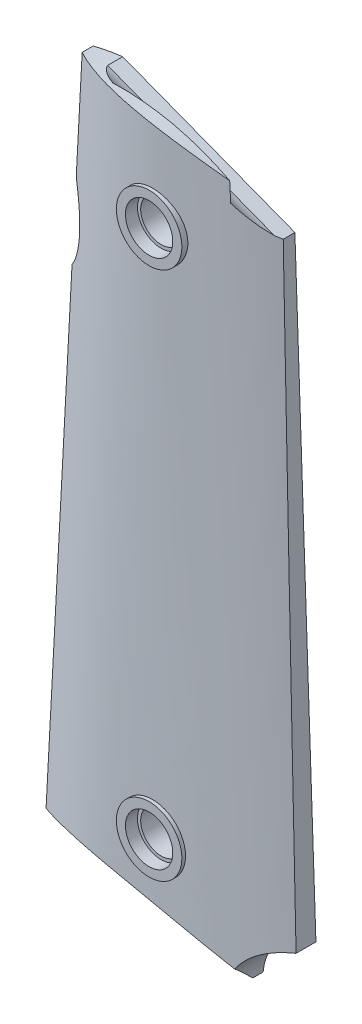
ISO-10303-21;
HEADER;
FILE_DESCRIPTION(('STEP AP214'),'2;1');
FILE_NAME('part.step','',(''),(''),'','','');
FILE_SCHEMA(('AUTOMOTIVE_DESIGN { 1 0 10303 214 1 1 1 1 }'));
ENDSEC;
DATA;
#1=APPLICATION_CONTEXT('core data for automotive mechanical design processes');
#2=APPLICATION_PROTOCOL_DEFINITION('international standard','automotive_design',2000,#1);
#3=PRODUCT_CONTEXT('',#1,'mechanical');
#4=PRODUCT('Part','Part','',(#3));
#5=PRODUCT_RELATED_PRODUCT_CATEGORY('part','',(#4));
#6=PRODUCT_DEFINITION_FORMATION('','',#4);
#7=PRODUCT_DEFINITION_CONTEXT('part definition',#1,'design');
#8=PRODUCT_DEFINITION('design','',#6,#7);
#9=PRODUCT_DEFINITION_SHAPE('','',#8);
#10=(LENGTH_UNIT() NAMED_UNIT(*) SI_UNIT(.MILLI.,.METRE.));
#11=(NAMED_UNIT(*) PLANE_ANGLE_UNIT() SI_UNIT($,.RADIAN.));
#12=(NAMED_UNIT(*) SI_UNIT($,.STERADIAN.) SOLID_ANGLE_UNIT());
#13=UNCERTAINTY_MEASURE_WITH_UNIT(LENGTH_MEASURE(1.E-05),#10,'distance_accuracy_value','');
#14=(GEOMETRIC_REPRESENTATION_CONTEXT(3) GLOBAL_UNCERTAINTY_ASSIGNED_CONTEXT((#13)) GLOBAL_UNIT_ASSIGNED_CONTEXT((#10,
#11,#12)) REPRESENTATION_CONTEXT('',''));
#15=CARTESIAN_POINT('',(0.,0.,0.));
#16=DIRECTION('',(0.,0.,1.));
#17=DIRECTION('',(1.,0.,0.));
#18=AXIS2_PLACEMENT_3D('',#15,#16,#17);
#19=CARTESIAN_POINT('',(0.,0.,6.096));
#20=DIRECTION('',(0.,0.,-1.));
#21=DIRECTION('',(-1.,0.,0.));
#22=AXIS2_PLACEMENT_3D('',#19,#20,#21);
#23=CYLINDRICAL_SURFACE('',#22,3.0226);
#24=CARTESIAN_POINT('',(0.,0.,4.826));
#25=DIRECTION('',(0.,0.,-1.));
#26=DIRECTION('',(-1.,0.,0.));
#27=AXIS2_PLACEMENT_3D('',#24,#25,#26);
#28=CIRCLE('',#27,3.0226);
#29=CARTESIAN_POINT('',(-3.0226,0.,4.826));
#30=VERTEX_POINT('',#29);
#31=EDGE_CURVE('E479',#30,#30,#28,.T.);
#32=CARTESIAN_POINT('',(0.,0.,1.397));
#33=DIRECTION('',(0.,0.,-1.));
#34=DIRECTION('',(-1.,0.,0.));
#35=AXIS2_PLACEMENT_3D('',#32,#33,#34);
#36=CIRCLE('',#35,3.0226);
#37=CARTESIAN_POINT('',(-3.0226,0.,1.397));
#38=VERTEX_POINT('',#37);
#39=EDGE_CURVE('E487',#38,#38,#36,.T.);
#40=CARTESIAN_POINT('',(-3.0226,0.,4.826));
#41=CARTESIAN_POINT('',(-3.0226,0.,4.79028125));
#42=CARTESIAN_POINT('',(-3.0226,0.,4.7545625));
#43=CARTESIAN_POINT('',(-3.0226,0.,4.683125));
#44=CARTESIAN_POINT('',(-3.0226,0.,4.64740625));
#45=CARTESIAN_POINT('',(-3.0226,0.,4.57596875));
#46=CARTESIAN_POINT('',(-3.0226,0.,4.54025));
#47=CARTESIAN_POINT('',(-3.0226,0.,4.4688125));
#48=CARTESIAN_POINT('',(-3.0226,0.,4.43309375));
#49=CARTESIAN_POINT('',(-3.0226,0.,4.36165625));
#50=CARTESIAN_POINT('',(-3.0226,0.,4.3259375));
#51=CARTESIAN_POINT('',(-3.0226,0.,4.2545));
#52=CARTESIAN_POINT('',(-3.0226,0.,4.21878125));
#53=CARTESIAN_POINT('',(-3.0226,0.,4.14734375));
#54=CARTESIAN_POINT('',(-3.0226,0.,4.111625));
#55=CARTESIAN_POINT('',(-3.0226,0.,4.0401875));
#56=CARTESIAN_POINT('',(-3.0226,0.,4.00446875));
#57=CARTESIAN_POINT('',(-3.0226,0.,3.93303125));
#58=CARTESIAN_POINT('',(-3.0226,0.,3.8973125));
#59=CARTESIAN_POINT('',(-3.0226,0.,3.825875));
#60=CARTESIAN_POINT('',(-3.0226,0.,3.79015625));
#61=CARTESIAN_POINT('',(-3.0226,0.,3.71871875));
#62=CARTESIAN_POINT('',(-3.0226,0.,3.683));
#63=CARTESIAN_POINT('',(-3.0226,0.,3.6115625));
#64=CARTESIAN_POINT('',(-3.0226,0.,3.57584375));
#65=CARTESIAN_POINT('',(-3.0226,0.,3.50440625));
#66=CARTESIAN_POINT('',(-3.0226,0.,3.4686875));
#67=CARTESIAN_POINT('',(-3.0226,0.,3.39725));
#68=CARTESIAN_POINT('',(-3.0226,0.,3.36153125));
#69=CARTESIAN_POINT('',(-3.0226,0.,3.29009375));
#70=CARTESIAN_POINT('',(-3.0226,0.,3.254375));
#71=CARTESIAN_POINT('',(-3.0226,0.,3.1829375));
#72=CARTESIAN_POINT('',(-3.0226,0.,3.14721875));
#73=CARTESIAN_POINT('',(-3.0226,0.,3.07578125));
#74=CARTESIAN_POINT('',(-3.0226,0.,3.0400625));
#75=CARTESIAN_POINT('',(-3.0226,0.,2.968625));
#76=CARTESIAN_POINT('',(-3.0226,0.,2.93290625));
#77=CARTESIAN_POINT('',(-3.0226,0.,2.86146875));
#78=CARTESIAN_POINT('',(-3.0226,0.,2.82575));
#79=CARTESIAN_POINT('',(-3.0226,0.,2.7543125));
#80=CARTESIAN_POINT('',(-3.0226,0.,2.71859375));
#81=CARTESIAN_POINT('',(-3.0226,0.,2.64715625));
#82=CARTESIAN_POINT('',(-3.0226,0.,2.6114375));
#83=CARTESIAN_POINT('',(-3.0226,0.,2.54));
#84=CARTESIAN_POINT('',(-3.0226,0.,2.50428125));
#85=CARTESIAN_POINT('',(-3.0226,0.,2.43284375));
#86=CARTESIAN_POINT('',(-3.0226,0.,2.397125));
#87=CARTESIAN_POINT('',(-3.0226,0.,2.3256875));
#88=CARTESIAN_POINT('',(-3.0226,0.,2.28996875));
#89=CARTESIAN_POINT('',(-3.0226,0.,2.21853125));
#90=CARTESIAN_POINT('',(-3.0226,0.,2.1828125));
#91=CARTESIAN_POINT('',(-3.0226,0.,2.111375));
#92=CARTESIAN_POINT('',(-3.0226,0.,2.07565625));
#93=CARTESIAN_POINT('',(-3.0226,0.,2.00421875));
#94=CARTESIAN_POINT('',(-3.0226,0.,1.9685));
#95=CARTESIAN_POINT('',(-3.0226,0.,1.8970625));
#96=CARTESIAN_POINT('',(-3.0226,0.,1.86134375));
#97=CARTESIAN_POINT('',(-3.0226,0.,1.78990625));
#98=CARTESIAN_POINT('',(-3.0226,0.,1.7541875));
#99=CARTESIAN_POINT('',(-3.0226,0.,1.68275));
#100=CARTESIAN_POINT('',(-3.0226,0.,1.64703125));
#101=CARTESIAN_POINT('',(-3.0226,0.,1.57559375));
#102=CARTESIAN_POINT('',(-3.0226,0.,1.539875));
#103=CARTESIAN_POINT('',(-3.0226,0.,1.4684375));
#104=CARTESIAN_POINT('',(-3.0226,0.,1.43271875));
#105=CARTESIAN_POINT('',(-3.0226,0.,1.397));
#106=B_SPLINE_CURVE_WITH_KNOTS('',3,(#40,#41,#42,#43,#44,#45,#46,#47,#48,#49,#50,#51,#52,#53,
#54,#55,#56,#57,#58,#59,#60,#61,#62,#63,#64,#65,#66,#67,#68,#69,#70,#71,#72,#73,#74,#75,#76,#77,
#78,#79,#80,#81,#82,#83,#84,#85,#86,#87,#88,#89,#90,#91,#92,#93,#94,#95,#96,#97,#98,#99,#100,
#101,#102,#103,#104,#105),.UNSPECIFIED.,.F.,.F.,(4,2,2,2,2,2,2,2,2,2,2,2,2,2,2,2,2,2,2,2,2,2,2,
2,2,2,2,2,2,2,2,2,4),(0.,0.10715625,0.2143125,0.321468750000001,0.428625,0.535781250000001,
0.6429375,0.750093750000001,0.85725,0.96440625,1.0715625,1.17871875,1.285875,1.39303125,
1.5001875,1.60734375,1.7145,1.82165625,1.9288125,2.03596875,2.143125,2.25028125,2.3574375,
2.46459375,2.57175,2.67890625,2.7860625,2.89321875,3.000375,3.10753125,3.2146875,3.32184375,
3.429),.UNSPECIFIED.);
#107=EDGE_CURVE('BSEAM89',#30,#38,#106,.T.);
#108=ORIENTED_EDGE('',*,*,#31,.F.);
#109=ORIENTED_EDGE('',*,*,#39,.T.);
#110=ORIENTED_EDGE('',*,*,#107,.T.);
#111=ORIENTED_EDGE('',*,*,#107,.F.);
#112=EDGE_LOOP('',(#108,#110,#109,#111));
#113=FACE_BOUND('',#112,.T.);
#114=ADVANCED_FACE('F89',(#113),#23,.F.);
#115=CARTESIAN_POINT('',(0.,78.0796,6.096));
#116=DIRECTION('',(0.,0.,-1.));
#117=DIRECTION('',(-1.,0.,0.));
#118=AXIS2_PLACEMENT_3D('',#115,#116,#117);
#119=CYLINDRICAL_SURFACE('',#118,3.0226);
#120=CARTESIAN_POINT('',(0.,78.0796,4.826));
#121=DIRECTION('',(0.,0.,-1.));
#122=DIRECTION('',(-1.,0.,0.));
#123=AXIS2_PLACEMENT_3D('',#120,#121,#122);
#124=CIRCLE('',#123,3.0226);
#125=CARTESIAN_POINT('',(-3.0226,78.0796,4.826));
#126=VERTEX_POINT('',#125);
#127=EDGE_CURVE('E483',#126,#126,#124,.T.);
#128=CARTESIAN_POINT('',(0.,78.0796,1.397));
#129=DIRECTION('',(0.,0.,-1.));
#130=DIRECTION('',(-1.,0.,0.));
#131=AXIS2_PLACEMENT_3D('',#128,#129,#130);
#132=CIRCLE('',#131,3.0226);
#133=CARTESIAN_POINT('',(-3.0226,78.0796,1.397));
#134=VERTEX_POINT('',#133);
#135=EDGE_CURVE('E494',#134,#134,#132,.T.);
#136=CARTESIAN_POINT('',(-3.0226,78.0796,4.826));
#137=CARTESIAN_POINT('',(-3.0226,78.0796,4.79028125));
#138=CARTESIAN_POINT('',(-3.0226,78.0796,4.7545625));
#139=CARTESIAN_POINT('',(-3.0226,78.0796,4.683125));
#140=CARTESIAN_POINT('',(-3.0226,78.0796,4.64740625));
#141=CARTESIAN_POINT('',(-3.0226,78.0796,4.57596875));
#142=CARTESIAN_POINT('',(-3.0226,78.0796,4.54025));
#143=CARTESIAN_POINT('',(-3.0226,78.0796,4.4688125));
#144=CARTESIAN_POINT('',(-3.0226,78.0796,4.43309375));
#145=CARTESIAN_POINT('',(-3.0226,78.0796,4.36165625));
#146=CARTESIAN_POINT('',(-3.0226,78.0796,4.3259375));
#147=CARTESIAN_POINT('',(-3.0226,78.0796,4.2545));
#148=CARTESIAN_POINT('',(-3.0226,78.0796,4.21878125));
#149=CARTESIAN_POINT('',(-3.0226,78.0796,4.14734375));
#150=CARTESIAN_POINT('',(-3.0226,78.0796,4.111625));
#151=CARTESIAN_POINT('',(-3.0226,78.0796,4.0401875));
#152=CARTESIAN_POINT('',(-3.0226,78.0796,4.00446875));
#153=CARTESIAN_POINT('',(-3.0226,78.0796,3.93303125));
#154=CARTESIAN_POINT('',(-3.0226,78.0796,3.8973125));
#155=CARTESIAN_POINT('',(-3.0226,78.0796,3.825875));
#156=CARTESIAN_POINT('',(-3.0226,78.0796,3.79015625));
#157=CARTESIAN_POINT('',(-3.0226,78.0796,3.71871875));
#158=CARTESIAN_POINT('',(-3.0226,78.0796,3.683));
#159=CARTESIAN_POINT('',(-3.0226,78.0796,3.6115625));
#160=CARTESIAN_POINT('',(-3.0226,78.0796,3.57584375));
#161=CARTESIAN_POINT('',(-3.0226,78.0796,3.50440625));
#162=CARTESIAN_POINT('',(-3.0226,78.0796,3.4686875));
#163=CARTESIAN_POINT('',(-3.0226,78.0796,3.39725));
#164=CARTESIAN_POINT('',(-3.0226,78.0796,3.36153125));
#165=CARTESIAN_POINT('',(-3.0226,78.0796,3.29009375));
#166=CARTESIAN_POINT('',(-3.0226,78.0796,3.254375));
#167=CARTESIAN_POINT('',(-3.0226,78.0796,3.1829375));
#168=CARTESIAN_POINT('',(-3.0226,78.0796,3.14721875));
#169=CARTESIAN_POINT('',(-3.0226,78.0796,3.07578125));
#170=CARTESIAN_POINT('',(-3.0226,78.0796,3.0400625));
#171=CARTESIAN_POINT('',(-3.0226,78.0796,2.968625));
#172=CARTESIAN_POINT('',(-3.0226,78.0796,2.93290625));
#173=CARTESIAN_POINT('',(-3.0226,78.0796,2.86146875));
#174=CARTESIAN_POINT('',(-3.0226,78.0796,2.82575));
#175=CARTESIAN_POINT('',(-3.0226,78.0796,2.7543125));
#176=CARTESIAN_POINT('',(-3.0226,78.0796,2.71859375));
#177=CARTESIAN_POINT('',(-3.0226,78.0796,2.64715625));
#178=CARTESIAN_POINT('',(-3.0226,78.0796,2.6114375));
#179=CARTESIAN_POINT('',(-3.0226,78.0796,2.54));
#180=CARTESIAN_POINT('',(-3.0226,78.0796,2.50428125));
#181=CARTESIAN_POINT('',(-3.0226,78.0796,2.43284375));
#182=CARTESIAN_POINT('',(-3.0226,78.0796,2.397125));
#183=CARTESIAN_POINT('',(-3.0226,78.0796,2.3256875));
#184=CARTESIAN_POINT('',(-3.0226,78.0796,2.28996875));
#185=CARTESIAN_POINT('',(-3.0226,78.0796,2.21853125));
#186=CARTESIAN_POINT('',(-3.0226,78.0796,2.1828125));
#187=CARTESIAN_POINT('',(-3.0226,78.0796,2.111375));
#188=CARTESIAN_POINT('',(-3.0226,78.0796,2.07565625));
#189=CARTESIAN_POINT('',(-3.0226,78.0796,2.00421875));
#190=CARTESIAN_POINT('',(-3.0226,78.0796,1.9685));
#191=CARTESIAN_POINT('',(-3.0226,78.0796,1.8970625));
#192=CARTESIAN_POINT('',(-3.0226,78.0796,1.86134375));
#193=CARTESIAN_POINT('',(-3.0226,78.0796,1.78990625));
#194=CARTESIAN_POINT('',(-3.0226,78.0796,1.7541875));
#195=CARTESIAN_POINT('',(-3.0226,78.0796,1.68275));
#196=CARTESIAN_POINT('',(-3.0226,78.0796,1.64703125));
#197=CARTESIAN_POINT('',(-3.0226,78.0796,1.57559375));
#198=CARTESIAN_POINT('',(-3.0226,78.0796,1.539875));
#199=CARTESIAN_POINT('',(-3.0226,78.0796,1.4684375));
#200=CARTESIAN_POINT('',(-3.0226,78.0796,1.43271875));
#201=CARTESIAN_POINT('',(-3.0226,78.0796,1.397));
#202=B_SPLINE_CURVE_WITH_KNOTS('',3,(#136,#137,#138,#139,#140,#141,#142,#143,#144,#145,#146,
#147,#148,#149,#150,#151,#152,#153,#154,#155,#156,#157,#158,#159,#160,#161,#162,#163,#164,#165,
#166,#167,#168,#169,#170,#171,#172,#173,#174,#175,#176,#177,#178,#179,#180,#181,#182,#183,#184,
#185,#186,#187,#188,#189,#190,#191,#192,#193,#194,#195,#196,#197,#198,#199,#200,#201),
.UNSPECIFIED.,.F.,.F.,(4,2,2,2,2,2,2,2,2,2,2,2,2,2,2,2,2,2,2,2,2,2,2,2,2,2,2,2,2,2,2,2,4),(0.,
0.10715625,0.2143125,0.321468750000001,0.428625,0.535781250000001,0.6429375,0.750093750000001,
0.85725,0.96440625,1.0715625,1.17871875,1.285875,1.39303125,1.5001875,1.60734375,1.7145,
1.82165625,1.9288125,2.03596875,2.143125,2.25028125,2.3574375,2.46459375,2.57175,2.67890625,
2.7860625,2.89321875,3.000375,3.10753125,3.2146875,3.32184375,3.429),.UNSPECIFIED.);
#203=EDGE_CURVE('BSEAM569',#126,#134,#202,.T.);
#204=ORIENTED_EDGE('',*,*,#127,.F.);
#205=ORIENTED_EDGE('',*,*,#135,.T.);
#206=ORIENTED_EDGE('',*,*,#203,.T.);
#207=ORIENTED_EDGE('',*,*,#203,.F.);
#208=EDGE_LOOP('',(#204,#206,#205,#207));
#209=FACE_BOUND('',#208,.T.);
#210=ADVANCED_FACE('F569',(#209),#119,.F.);
#211=CARTESIAN_POINT('',(18.796,-16.002,0.));
#212=DIRECTION('',(0.,0.,-1.));
#213=DIRECTION('',(-1.,0.,0.));
#214=AXIS2_PLACEMENT_3D('',#211,#212,#213);
#215=PLANE('',#214);
#216=CARTESIAN_POINT('',(8.144899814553,12.3101956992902,0.));
#217=DIRECTION('',(0.,0.,-1.));
#218=DIRECTION('',(-1.,0.,0.));
#219=AXIS2_PLACEMENT_3D('',#216,#217,#218);
#220=CIRCLE('',#219,4.16241072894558);
#221=CARTESIAN_POINT('',(12.3047881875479,12.4550811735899,0.));
#222=VERTEX_POINT('',#221);
#223=CARTESIAN_POINT('',(8.144899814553,8.14778497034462,0.));
#224=VERTEX_POINT('',#223);
#225=EDGE_CURVE('E111',#222,#224,#220,.T.);
#226=ORIENTED_EDGE('',*,*,#225,.F.);
#227=DIRECTION('',(0.0348080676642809,-0.999394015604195,0.));
#228=VECTOR('',#227,1.);
#229=CARTESIAN_POINT('',(11.4007677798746,38.4109197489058,0.));
#230=LINE('',#229,#228);
#231=CARTESIAN_POINT('',(11.4007677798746,38.4109197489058,0.));
#232=VERTEX_POINT('',#231);
#233=EDGE_CURVE('E320',#232,#222,#230,.T.);
#234=ORIENTED_EDGE('',*,*,#233,.F.);
#235=DIRECTION('',(1.,0.,0.));
#236=VECTOR('',#235,1.);
#237=CARTESIAN_POINT('',(2.20353864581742,38.4109197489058,0.));
#238=LINE('',#237,#236);
#239=CARTESIAN_POINT('',(2.20353864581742,38.4109197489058,0.));
#240=VERTEX_POINT('',#239);
#241=EDGE_CURVE('E323',#240,#232,#238,.T.);
#242=ORIENTED_EDGE('',*,*,#241,.F.);
#243=DIRECTION('',(0.,1.,0.));
#244=VECTOR('',#243,1.);
#245=CARTESIAN_POINT('',(2.20353864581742,8.14778497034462,0.));
#246=LINE('',#245,#244);
#247=CARTESIAN_POINT('',(2.20353864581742,8.14778497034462,0.));
#248=VERTEX_POINT('',#247);
#249=EDGE_CURVE('E333',#248,#240,#246,.T.);
#250=ORIENTED_EDGE('',*,*,#249,.F.);
#251=DIRECTION('',(-1.,0.,0.));
#252=VECTOR('',#251,1.);
#253=CARTESIAN_POINT('',(8.144899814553,8.14778497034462,0.));
#254=LINE('',#253,#252);
#255=EDGE_CURVE('E331',#224,#248,#254,.T.);
#256=ORIENTED_EDGE('',*,*,#255,.F.);
#257=EDGE_LOOP('',(#226,#234,#242,#250,#256));
#258=FACE_BOUND('',#257,.T.);
#259=CARTESIAN_POINT('',(-8.15529225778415,12.2808609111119,0.));
#260=DIRECTION('',(0.,0.,-1.));
#261=DIRECTION('',(-1.,0.,0.));
#262=AXIS2_PLACEMENT_3D('',#259,#260,#261);
#263=CIRCLE('',#262,4.13307594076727);
#264=CARTESIAN_POINT('',(-8.15529225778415,8.14778497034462,0.));
#265=VERTEX_POINT('',#264);
#266=CARTESIAN_POINT('',(-12.2858636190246,12.4247252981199,0.));
#267=VERTEX_POINT('',#266);
#268=EDGE_CURVE('E119',#265,#267,#263,.T.);
#269=ORIENTED_EDGE('',*,*,#268,.F.);
#270=DIRECTION('',(-1.,0.,0.));
#271=VECTOR('',#270,1.);
#272=CARTESIAN_POINT('',(-2.20353864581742,8.14778497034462,0.));
#273=LINE('',#272,#271);
#274=CARTESIAN_POINT('',(-2.20353864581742,8.14778497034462,0.));
#275=VERTEX_POINT('',#274);
#276=EDGE_CURVE('E349',#275,#265,#273,.T.);
#277=ORIENTED_EDGE('',*,*,#276,.F.);
#278=DIRECTION('',(0.,-1.,0.));
#279=VECTOR('',#278,1.);
#280=CARTESIAN_POINT('',(-2.20353864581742,38.4109197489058,0.));
#281=LINE('',#280,#279);
#282=CARTESIAN_POINT('',(-2.20353864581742,38.4109197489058,0.));
#283=VERTEX_POINT('',#282);
#284=EDGE_CURVE('E369',#283,#275,#281,.T.);
#285=ORIENTED_EDGE('',*,*,#284,.F.);
#286=DIRECTION('',(1.,0.,0.));
#287=VECTOR('',#286,1.);
#288=CARTESIAN_POINT('',(-11.3807859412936,38.4109197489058,0.));
#289=LINE('',#288,#287);
#290=CARTESIAN_POINT('',(-11.3807859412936,38.4109197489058,0.));
#291=VERTEX_POINT('',#290);
#292=EDGE_CURVE('E366',#291,#283,#289,.T.);
#293=ORIENTED_EDGE('',*,*,#292,.F.);
#294=DIRECTION('',(0.0348080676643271,0.999394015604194,0.));
#295=VECTOR('',#294,1.);
#296=CARTESIAN_POINT('',(-12.2858636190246,12.4247252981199,0.));
#297=LINE('',#296,#295);
#298=EDGE_CURVE('E363',#267,#291,#297,.T.);
#299=ORIENTED_EDGE('',*,*,#298,.F.);
#300=EDGE_LOOP('',(#269,#277,#285,#293,#299));
#301=FACE_BOUND('',#300,.T.);
#302=CARTESIAN_POINT('',(-6.31794324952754,65.0340220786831,0.));
#303=DIRECTION('',(0.,0.,-1.));
#304=DIRECTION('',(1.,0.,0.));
#305=AXIS2_PLACEMENT_3D('',#302,#303,#304);
#306=CIRCLE('',#305,4.13307594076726);
#307=CARTESIAN_POINT('',(-10.448514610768,65.1778864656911,0.));
#308=VERTEX_POINT('',#307);
#309=CARTESIAN_POINT('',(-6.31794324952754,69.1670980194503,0.));
#310=VERTEX_POINT('',#309);
#311=EDGE_CURVE('E376',#308,#310,#306,.T.);
#312=ORIENTED_EDGE('',*,*,#311,.F.);
#313=DIRECTION('',(0.0348080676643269,0.999394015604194,0.));
#314=VECTOR('',#313,1.);
#315=CARTESIAN_POINT('',(-11.2272910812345,42.8179970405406,0.));
#316=LINE('',#315,#314);
#317=CARTESIAN_POINT('',(-11.2272910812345,42.8179970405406,0.));
#318=VERTEX_POINT('',#317);
#319=EDGE_CURVE('E388',#318,#308,#316,.T.);
#320=ORIENTED_EDGE('',*,*,#319,.F.);
#321=DIRECTION('',(-1.,0.,0.));
#322=VECTOR('',#321,1.);
#323=CARTESIAN_POINT('',(-2.20353864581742,42.8179970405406,0.));
#324=LINE('',#323,#322);
#325=CARTESIAN_POINT('',(-2.20353864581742,42.8179970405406,0.));
#326=VERTEX_POINT('',#325);
#327=EDGE_CURVE('E408',#326,#318,#324,.T.);
#328=ORIENTED_EDGE('',*,*,#327,.F.);
#329=DIRECTION('',(0.,-1.,0.));
#330=VECTOR('',#329,1.);
#331=CARTESIAN_POINT('',(-2.20353864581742,69.1670980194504,0.));
#332=LINE('',#331,#330);
#333=CARTESIAN_POINT('',(-2.20353864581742,69.1670980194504,0.));
#334=VERTEX_POINT('',#333);
#335=EDGE_CURVE('E405',#334,#326,#332,.T.);
#336=ORIENTED_EDGE('',*,*,#335,.F.);
#337=DIRECTION('',(1.,0.,0.));
#338=VECTOR('',#337,1.);
#339=CARTESIAN_POINT('',(-6.31794324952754,69.1670980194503,0.));
#340=LINE('',#339,#338);
#341=EDGE_CURVE('E402',#310,#334,#340,.T.);
#342=ORIENTED_EDGE('',*,*,#341,.F.);
#343=EDGE_LOOP('',(#312,#320,#328,#336,#342));
#344=FACE_BOUND('',#343,.T.);
#345=CARTESIAN_POINT('',(6.30959421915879,65.0046872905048,0.));
#346=DIRECTION('',(0.,0.,-1.));
#347=DIRECTION('',(1.,0.,0.));
#348=AXIS2_PLACEMENT_3D('',#345,#346,#347);
#349=CIRCLE('',#348,4.16241072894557);
#350=CARTESIAN_POINT('',(6.3095942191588,69.1670980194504,0.));
#351=VERTEX_POINT('',#350);
#352=CARTESIAN_POINT('',(10.4694825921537,65.1495727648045,0.));
#353=VERTEX_POINT('',#352);
#354=EDGE_CURVE('E415',#351,#353,#349,.T.);
#355=ORIENTED_EDGE('',*,*,#354,.F.);
#356=DIRECTION('',(1.,0.,0.));
#357=VECTOR('',#356,1.);
#358=CARTESIAN_POINT('',(2.20353864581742,69.1670980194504,0.));
#359=LINE('',#358,#357);
#360=CARTESIAN_POINT('',(2.20353864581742,69.1670980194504,0.));
#361=VERTEX_POINT('',#360);
#362=EDGE_CURVE('E428',#361,#351,#359,.T.);
#363=ORIENTED_EDGE('',*,*,#362,.F.);
#364=DIRECTION('',(0.,1.,0.));
#365=VECTOR('',#364,1.);
#366=CARTESIAN_POINT('',(2.20353864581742,42.8179970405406,0.));
#367=LINE('',#366,#365);
#368=CARTESIAN_POINT('',(2.20353864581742,42.8179970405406,0.));
#369=VERTEX_POINT('',#368);
#370=EDGE_CURVE('E448',#369,#361,#367,.T.);
#371=ORIENTED_EDGE('',*,*,#370,.F.);
#372=DIRECTION('',(-1.,0.,0.));
#373=VECTOR('',#372,1.);
#374=CARTESIAN_POINT('',(11.2472729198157,42.8179970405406,0.));
#375=LINE('',#374,#373);
#376=CARTESIAN_POINT('',(11.2472729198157,42.8179970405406,0.));
#377=VERTEX_POINT('',#376);
#378=EDGE_CURVE('E445',#377,#369,#375,.T.);
#379=ORIENTED_EDGE('',*,*,#378,.F.);
#380=DIRECTION('',(0.0348080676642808,-0.999394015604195,0.));
#381=VECTOR('',#380,1.);
#382=CARTESIAN_POINT('',(10.4694825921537,65.1495727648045,0.));
#383=LINE('',#382,#381);
#384=EDGE_CURVE('E442',#353,#377,#383,.T.);
#385=ORIENTED_EDGE('',*,*,#384,.F.);
#386=EDGE_LOOP('',(#355,#363,#371,#379,#385));
#387=FACE_BOUND('',#386,.T.);
#388=CARTESIAN_POINT('',(0.,0.,0.));
#389=DIRECTION('',(0.,0.,-1.));
#390=DIRECTION('',(-1.,0.,0.));
#391=AXIS2_PLACEMENT_3D('',#388,#389,#390);
#392=CIRCLE('',#391,3.7465);
#393=CARTESIAN_POINT('',(-3.7465,0.,0.));
#394=VERTEX_POINT('',#393);
#395=EDGE_CURVE('E488',#394,#394,#392,.T.);
#396=ORIENTED_EDGE('',*,*,#395,.F.);
#397=EDGE_LOOP('',(#396));
#398=FACE_BOUND('',#397,.T.);
#399=CARTESIAN_POINT('',(0.,78.0796,0.));
#400=DIRECTION('',(0.,0.,-1.));
#401=DIRECTION('',(-1.,0.,0.));
#402=AXIS2_PLACEMENT_3D('',#399,#400,#401);
#403=CIRCLE('',#402,3.7465);
#404=CARTESIAN_POINT('',(-3.7465,78.0796,0.));
#405=VERTEX_POINT('',#404);
#406=EDGE_CURVE('E495',#405,#405,#403,.T.);
#407=ORIENTED_EDGE('',*,*,#406,.F.);
#408=EDGE_LOOP('',(#407));
#409=FACE_BOUND('',#408,.T.);
#410=DIRECTION('',(-0.933580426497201,0.358367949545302,0.));
#411=VECTOR('',#410,1.);
#412=CARTESIAN_POINT('',(50.9642740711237,67.799219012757,0.));
#413=LINE('',#412,#411);
#414=CARTESIAN_POINT('',(14.8963431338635,81.6444005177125,0.));
#415=VERTEX_POINT('',#414);
#416=CARTESIAN_POINT('',(-10.5061821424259,91.3955163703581,0.));
#417=VERTEX_POINT('',#416);
#418=EDGE_CURVE('E515',#415,#417,#413,.T.);
#419=ORIENTED_EDGE('',*,*,#418,.F.);
#420=DIRECTION('',(-0.0348080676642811,0.999394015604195,0.));
#421=VECTOR('',#420,1.);
#422=CARTESIAN_POINT('',(14.7998475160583,84.4149404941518,0.));
#423=LINE('',#422,#421);
#424=CARTESIAN_POINT('',(17.9977893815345,-7.4029677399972,0.));
#425=VERTEX_POINT('',#424);
#426=EDGE_CURVE('E740',#425,#415,#423,.T.);
#427=ORIENTED_EDGE('',*,*,#426,.F.);
#428=CARTESIAN_POINT('',(18.796,-16.002,0.));
#429=DIRECTION('',(0.,0.,-1.));
#430=DIRECTION('',(-1.,0.,0.));
#431=AXIS2_PLACEMENT_3D('',#428,#429,#430);
#432=CIRCLE('',#431,8.636);
#433=CARTESIAN_POINT('',(10.2019118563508,-15.1522088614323,0.));
#434=VERTEX_POINT('',#433);
#435=EDGE_CURVE('E745',#434,#425,#432,.T.);
#436=ORIENTED_EDGE('',*,*,#435,.F.);
#437=DIRECTION('',(0.978147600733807,-0.207911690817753,0.));
#438=VECTOR('',#437,1.);
#439=CARTESIAN_POINT('',(10.2019118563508,-15.1522088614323,0.));
#440=LINE('',#439,#438);
#441=CARTESIAN_POINT('',(-20.0675581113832,-8.71823440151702,0.));
#442=VERTEX_POINT('',#441);
#443=EDGE_CURVE('E755',#442,#434,#440,.T.);
#444=ORIENTED_EDGE('',*,*,#443,.F.);
#445=DIRECTION('',(-0.0523747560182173,-0.998627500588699,0.));
#446=VECTOR('',#445,1.);
#447=CARTESIAN_POINT('',(-20.0675581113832,-8.71823440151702,0.));
#448=LINE('',#447,#446);
#449=CARTESIAN_POINT('',(-16.3155840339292,62.8205140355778,0.));
#450=VERTEX_POINT('',#449);
#451=EDGE_CURVE('E752',#450,#442,#448,.T.);
#452=ORIENTED_EDGE('',*,*,#451,.F.);
#453=CARTESIAN_POINT('',(-23.114,68.9356,0.));
#454=DIRECTION('',(0.,0.,-1.));
#455=DIRECTION('',(1.,0.,0.));
#456=AXIS2_PLACEMENT_3D('',#453,#454,#455);
#457=CIRCLE('',#456,9.144);
#458=CARTESIAN_POINT('',(-15.7132085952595,74.3059838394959,0.));
#459=VERTEX_POINT('',#458);
#460=EDGE_CURVE('E750',#459,#450,#457,.T.);
#461=ORIENTED_EDGE('',*,*,#460,.F.);
#462=DIRECTION('',(-0.0523747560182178,-0.998627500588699,0.));
#463=VECTOR('',#462,1.);
#464=CARTESIAN_POINT('',(-15.7132085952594,74.3059838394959,0.));
#465=LINE('',#464,#463);
#466=CARTESIAN_POINT('',(-14.859588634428,90.5819234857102,0.));
#467=VERTEX_POINT('',#466);
#468=EDGE_CURVE('E716',#467,#459,#465,.T.);
#469=ORIENTED_EDGE('',*,*,#468,.F.);
#470=CARTESIAN_POINT('',(-6.35,57.1024545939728,0.));
#471=DIRECTION('',(0.,0.,1.));
#472=DIRECTION('',(-1.,0.,0.));
#473=AXIS2_PLACEMENT_3D('',#470,#471,#472);
#474=CIRCLE('',#473,34.544);
#475=EDGE_CURVE('E744',#417,#467,#474,.T.);
#476=ORIENTED_EDGE('',*,*,#475,.F.);
#477=EDGE_LOOP('',(#419,#427,#436,#444,#452,#461,#469,#476));
#478=FACE_BOUND('',#477,.T.);
#479=ADVANCED_FACE('F682',(#258,#301,#344,#387,#398,#409,#478),#215,.T.);
#480=CARTESIAN_POINT('',(18.796,-16.002,6.096));
#481=DIRECTION('',(0.,0.,-1.));
#482=DIRECTION('',(-1.,0.,0.));
#483=AXIS2_PLACEMENT_3D('',#480,#481,#482);
#484=CYLINDRICAL_SURFACE('',#483,8.636);
#485=CARTESIAN_POINT('',(17.9977893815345,-7.4029677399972,2.92848117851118));
#486=CARTESIAN_POINT('',(17.8464483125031,-7.41701232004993,3.01090984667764));
#487=CARTESIAN_POINT('',(17.6946116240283,-7.43514026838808,3.09176033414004));
#488=CARTESIAN_POINT('',(17.3903311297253,-7.47977994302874,3.25016422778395));
#489=CARTESIAN_POINT('',(17.2378870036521,-7.50629690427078,3.32771554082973));
#490=CARTESIAN_POINT('',(16.9329402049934,-7.56791984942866,3.47928973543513));
#491=CARTESIAN_POINT('',(16.780437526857,-7.60302729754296,3.5533120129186));
#492=CARTESIAN_POINT('',(16.4755538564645,-7.68209075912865,3.69783857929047));
#493=CARTESIAN_POINT('',(16.323174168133,-7.72606912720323,3.76833340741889));
#494=CARTESIAN_POINT('',(16.0195371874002,-7.82293306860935,3.9054533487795));
#495=CARTESIAN_POINT('',(15.8682796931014,-7.87581699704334,3.97207917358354));
#496=CARTESIAN_POINT('',(15.5675007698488,-7.99055786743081,4.10135653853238));
#497=CARTESIAN_POINT('',(15.4179792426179,-8.05241429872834,4.16400830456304));
#498=CARTESIAN_POINT('',(15.0462442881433,-8.21870567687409,4.31593768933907));
#499=CARTESIAN_POINT('',(14.8255058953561,-8.32885443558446,4.40265893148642));
#500=CARTESIAN_POINT('',(14.391696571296,-8.5693602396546,4.56678026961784));
#501=CARTESIAN_POINT('',(14.1786261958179,-8.69971874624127,4.64417969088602));
#502=CARTESIAN_POINT('',(13.7628617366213,-8.9798405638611,4.78958398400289));
#503=CARTESIAN_POINT('',(13.5601492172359,-9.12956759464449,4.85760594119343));
#504=CARTESIAN_POINT('',(13.1669721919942,-9.44772777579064,4.98466420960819));
#505=CARTESIAN_POINT('',(12.9765066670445,-9.61615936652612,5.0437012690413));
#506=CARTESIAN_POINT('',(12.6230657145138,-9.95787710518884,5.1493165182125));
#507=CARTESIAN_POINT('',(12.4590984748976,-10.129957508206,5.1964833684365));
#508=CARTESIAN_POINT('',(12.1451508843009,-10.4880722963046,5.28390122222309));
#509=CARTESIAN_POINT('',(11.9951703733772,-10.6741065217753,5.32415230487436));
#510=CARTESIAN_POINT('',(11.7104792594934,-11.0589997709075,5.39829473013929));
#511=CARTESIAN_POINT('',(11.5757842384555,-11.2578715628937,5.43217960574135));
#512=CARTESIAN_POINT('',(11.3230910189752,-11.6668074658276,5.49409851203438));
#513=CARTESIAN_POINT('',(11.2050921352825,-11.8768711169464,5.52213278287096));
#514=CARTESIAN_POINT('',(10.9892244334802,-12.3019543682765,5.57236450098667));
#515=CARTESIAN_POINT('',(10.8909734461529,-12.5167666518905,5.59467568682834));
#516=CARTESIAN_POINT('',(10.712283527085,-12.9540809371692,5.63474744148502));
#517=CARTESIAN_POINT('',(10.6318439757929,-13.1765826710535,5.65250816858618));
#518=CARTESIAN_POINT('',(10.4895777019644,-13.6272217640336,5.68390352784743));
#519=CARTESIAN_POINT('',(10.4277129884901,-13.8553465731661,5.69754658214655));
#520=CARTESIAN_POINT('',(10.3228907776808,-14.3159837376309,5.72113473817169));
#521=CARTESIAN_POINT('',(10.2799216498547,-14.5484933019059,5.73108211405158));
#522=CARTESIAN_POINT('',(10.2377854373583,-14.8438442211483,5.74149832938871));
#523=CARTESIAN_POINT('',(10.2296763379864,-14.9054338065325,5.74354958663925));
#524=CARTESIAN_POINT('',(10.2147946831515,-15.028727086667,5.74741954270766));
#525=CARTESIAN_POINT('',(10.2080209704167,-15.0904306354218,5.74923844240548));
#526=CARTESIAN_POINT('',(10.2019118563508,-15.1522088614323,5.75094422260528));
#527=B_SPLINE_CURVE_WITH_KNOTS('',3,(#485,#486,#487,#488,#489,#490,#491,#492,#493,#494,#495,
#496,#497,#498,#499,#500,#501,#502,#503,#504,#505,#506,#507,#508,#509,#510,#511,#512,#513,#514,
#515,#516,#517,#518,#519,#520,#521,#522,#523,#524,#525,#526),.UNSPECIFIED.,.F.,.F.,(4,2,2,2,2,2,
2,2,2,2,2,2,2,2,2,2,2,2,2,2,4),(0.,0.518676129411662,1.03767656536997,1.55676552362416,
2.07717929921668,2.59749705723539,3.11778521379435,3.90116862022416,4.68460869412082,
5.46660195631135,6.24853006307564,6.97461573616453,7.70069310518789,8.42750410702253,
9.15428527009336,9.86525113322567,10.5761922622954,11.2856692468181,11.99470892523,
12.1811648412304,12.3674584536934),.UNSPECIFIED.);
#528=CARTESIAN_POINT('',(17.9977893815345,-7.4029677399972,2.92848117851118));
#529=VERTEX_POINT('',#528);
#530=CARTESIAN_POINT('',(11.4842983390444,-11.4064026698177,5.45457455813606));
#531=VERTEX_POINT('',#530);
#532=EDGE_CURVE('E780',#529,#531,#527,.T.);
#533=ORIENTED_EDGE('',*,*,#532,.T.);
#534=CARTESIAN_POINT('',(18.796,-16.002,2.47959031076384));
#535=DIRECTION('',(0.1470157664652,0.691654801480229,-0.707106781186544));
#536=DIRECTION('',(-0.147015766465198,-0.691654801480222,-0.707106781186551));
#537=AXIS2_PLACEMENT_3D('',#534,#535,#536);
#538=ELLIPSE('',#537,12.2131483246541,8.636);
#539=CARTESIAN_POINT('',(10.2019118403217,-15.1522089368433,1.524));
#540=VERTEX_POINT('',#539);
#541=EDGE_CURVE('E503',#531,#540,#538,.F.);
#542=ORIENTED_EDGE('',*,*,#541,.T.);
#543=DIRECTION('',(0.,0.,-1.));
#544=VECTOR('',#543,1.);
#545=CARTESIAN_POINT('',(10.2019118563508,-15.1522088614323,6.096));
#546=LINE('',#545,#544);
#547=EDGE_CURVE('E758',#540,#434,#546,.T.);
#548=ORIENTED_EDGE('',*,*,#547,.T.);
#549=ORIENTED_EDGE('',*,*,#435,.T.);
#550=DIRECTION('',(0.,0.,-1.));
#551=VECTOR('',#550,1.);
#552=CARTESIAN_POINT('',(17.9977893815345,-7.4029677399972,6.096));
#553=LINE('',#552,#551);
#554=EDGE_CURVE('E723',#529,#425,#553,.T.);
#555=ORIENTED_EDGE('',*,*,#554,.F.);
#556=EDGE_LOOP('',(#533,#542,#548,#549,#555));
#557=FACE_BOUND('',#556,.T.);
#558=ADVANCED_FACE('F91',(#557),#484,.F.);
#559=CARTESIAN_POINT('',(14.7998475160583,84.4149404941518,6.096));
#560=DIRECTION('',(-0.999394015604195,-0.0348080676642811,0.));
#561=DIRECTION('',(0.0348080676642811,-0.999394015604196,0.));
#562=AXIS2_PLACEMENT_3D('',#559,#560,#561);
#563=PLANE('',#562);
#564=ORIENTED_EDGE('',*,*,#426,.T.);
#565=DIRECTION('',(0.,0.,1.));
#566=VECTOR('',#565,1.);
#567=CARTESIAN_POINT('',(14.8963431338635,81.6444005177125,6.096));
#568=LINE('',#567,#566);
#569=CARTESIAN_POINT('',(14.8963431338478,81.6444005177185,1.72154106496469));
#570=VERTEX_POINT('',#569);
#571=EDGE_CURVE('E510',#415,#570,#568,.T.);
#572=ORIENTED_EDGE('',*,*,#571,.T.);
#573=CARTESIAN_POINT('',(14.7998475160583,84.4149404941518,1.68002702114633));
#574=CARTESIAN_POINT('',(15.0953911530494,75.9294208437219,1.80761477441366));
#575=CARTESIAN_POINT('',(15.3909368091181,67.4438432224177,1.93129262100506));
#576=CARTESIAN_POINT('',(15.9820314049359,50.4725937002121,2.17170590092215));
#577=CARTESIAN_POINT('',(16.2775803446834,41.9869217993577,2.28844133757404));
#578=CARTESIAN_POINT('',(16.8105721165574,26.6838951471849,2.49349187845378));
#579=CARTESIAN_POINT('',(17.0480144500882,19.8665547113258,2.58288219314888));
#580=CARTESIAN_POINT('',(17.5229007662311,6.23182649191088,2.75818295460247));
#581=CARTESIAN_POINT('',(17.7603447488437,-0.585561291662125,2.84409340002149));
#582=CARTESIAN_POINT('',(17.9977893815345,-7.40296773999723,2.92848117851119));
#583=B_SPLINE_CURVE_WITH_KNOTS('',3,(#573,#574,#575,#576,#577,#578,#579,#580,#581,#582),
.UNSPECIFIED.,.F.,.F.,(4,2,2,2,4),(0.,25.4748683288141,50.9497244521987,71.4159030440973,
91.8820895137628),.UNSPECIFIED.);
#584=EDGE_CURVE('E595',#570,#529,#583,.T.);
#585=ORIENTED_EDGE('',*,*,#584,.T.);
#586=ORIENTED_EDGE('',*,*,#554,.T.);
#587=EDGE_LOOP('',(#564,#572,#585,#586));
#588=FACE_BOUND('',#587,.T.);
#589=ADVANCED_FACE('F707',(#588),#563,.F.);
#590=CARTESIAN_POINT('',(-6.35,57.1024545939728,6.096));
#591=DIRECTION('',(0.,0.,-1.));
#592=DIRECTION('',(-1.,0.,0.));
#593=AXIS2_PLACEMENT_3D('',#590,#591,#592);
#594=CYLINDRICAL_SURFACE('',#593,34.544);
#595=CARTESIAN_POINT('',(-14.859588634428,90.5819234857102,1.61491989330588));
#596=CARTESIAN_POINT('',(-14.515344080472,90.6694310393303,1.84416365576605));
#597=CARTESIAN_POINT('',(-14.1650764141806,90.7527976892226,2.06600476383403));
#598=CARTESIAN_POINT('',(-13.4528982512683,90.9102894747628,2.49433099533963));
#599=CARTESIAN_POINT('',(-13.0909793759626,90.9844077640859,2.70080469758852));
#600=CARTESIAN_POINT('',(-12.3563343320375,91.1223256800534,3.0975472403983));
#601=CARTESIAN_POINT('',(-11.9836059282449,91.1861231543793,3.28781269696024));
#602=CARTESIAN_POINT('',(-11.227180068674,91.3025697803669,3.65189383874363));
#603=CARTESIAN_POINT('',(-10.8434549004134,91.3551873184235,3.82566212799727));
#604=CARTESIAN_POINT('',(-10.0670460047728,91.4481141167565,4.15537489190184));
#605=CARTESIAN_POINT('',(-9.67436416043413,91.4884259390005,4.31132307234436));
#606=CARTESIAN_POINT('',(-8.88106038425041,91.5559032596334,4.60473900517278));
#607=CARTESIAN_POINT('',(-8.4804388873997,91.5830694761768,4.74220776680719));
#608=CARTESIAN_POINT('',(-7.67048726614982,91.6235995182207,4.9986344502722));
#609=CARTESIAN_POINT('',(-7.26112449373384,91.6368962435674,5.11750003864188));
#610=CARTESIAN_POINT('',(-6.43688112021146,91.6488042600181,5.33534031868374));
#611=CARTESIAN_POINT('',(-6.02200002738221,91.6474142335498,5.43431322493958));
#612=CARTESIAN_POINT('',(-5.18822013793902,91.6294306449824,5.61187427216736));
#613=CARTESIAN_POINT('',(-4.76932136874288,91.612837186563,5.69046255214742));
#614=CARTESIAN_POINT('',(-3.93000295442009,91.5641412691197,5.82675185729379));
#615=CARTESIAN_POINT('',(-3.50958886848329,91.5320738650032,5.88449958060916));
#616=CARTESIAN_POINT('',(-2.66792071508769,91.4522571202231,5.97929399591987));
#617=CARTESIAN_POINT('',(-2.24666664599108,91.4045077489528,6.01634064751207));
#618=CARTESIAN_POINT('',(-1.40496052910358,91.2933112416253,6.06989593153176));
#619=CARTESIAN_POINT('',(-0.984508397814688,91.229865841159,6.08640683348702));
#620=CARTESIAN_POINT('',(-0.272296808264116,91.1088924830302,6.09738852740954));
#621=CARTESIAN_POINT('',(0.0200773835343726,91.0553389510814,6.09700024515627));
#622=CARTESIAN_POINT('',(0.603180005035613,90.9407389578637,6.08662723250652));
#623=CARTESIAN_POINT('',(0.893908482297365,90.8796927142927,6.07664278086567));
#624=CARTESIAN_POINT('',(1.47324337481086,90.7502317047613,6.04735563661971));
#625=CARTESIAN_POINT('',(1.76184978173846,90.6818169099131,6.02805290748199));
#626=CARTESIAN_POINT('',(2.33650029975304,90.5377711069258,5.98041927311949));
#627=CARTESIAN_POINT('',(2.62254443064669,90.4621401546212,5.95208843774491));
#628=CARTESIAN_POINT('',(3.19200827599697,90.3037416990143,5.8867187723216));
#629=CARTESIAN_POINT('',(3.47542450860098,90.2209659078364,5.84966974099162));
#630=CARTESIAN_POINT('',(4.03894367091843,90.048540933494,5.76731888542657));
#631=CARTESIAN_POINT('',(4.31904660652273,89.9588917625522,5.72201707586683));
#632=CARTESIAN_POINT('',(4.87557514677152,89.7729377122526,5.62322882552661));
#633=CARTESIAN_POINT('',(5.15200078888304,89.6766329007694,5.56974246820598));
#634=CARTESIAN_POINT('',(5.70085711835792,89.477599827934,5.45489316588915));
#635=CARTESIAN_POINT('',(5.97328777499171,89.3748715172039,5.39353016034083));
#636=CARTESIAN_POINT('',(6.8251673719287,89.0413451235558,5.18820121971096));
#637=CARTESIAN_POINT('',(7.39698630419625,88.7992643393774,5.03046987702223));
#638=CARTESIAN_POINT('',(8.51870104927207,88.2888236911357,4.68307067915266));
#639=CARTESIAN_POINT('',(9.06859410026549,88.0204605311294,4.49339881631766));
#640=CARTESIAN_POINT('',(10.1447430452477,87.4599793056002,4.08521616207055));
#641=CARTESIAN_POINT('',(10.6710074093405,87.1678698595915,3.86671581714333));
#642=CARTESIAN_POINT('',(11.6989894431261,86.5622194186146,3.40375739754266));
#643=CARTESIAN_POINT('',(12.2007127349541,86.248683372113,3.15930530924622));
#644=CARTESIAN_POINT('',(13.0560050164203,85.683698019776,2.71150033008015));
#645=CARTESIAN_POINT('',(13.415089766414,85.4364748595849,2.51328092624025));
#646=CARTESIAN_POINT('',(14.1183968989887,84.9326426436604,2.10520476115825));
#647=CARTESIAN_POINT('',(14.4626494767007,84.6760548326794,1.89537384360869));
#648=CARTESIAN_POINT('',(14.7998475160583,84.4149404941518,1.68002702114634));
#649=B_SPLINE_CURVE_WITH_KNOTS('',3,(#595,#596,#597,#598,#599,#600,#601,#602,#603,#604,#605,
#606,#607,#608,#609,#610,#611,#612,#613,#614,#615,#616,#617,#618,#619,#620,#621,#622,#623,#624,
#625,#626,#627,#628,#629,#630,#631,#632,#633,#634,#635,#636,#637,#638,#639,#640,#641,#642,#643,
#644,#645,#646,#647,#648),.UNSPECIFIED.,.F.,.F.,(4,2,2,2,2,2,2,2,2,2,2,2,2,2,2,2,2,2,2,2,2,2,2,
2,2,2,4),(0.,1.26816154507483,2.5372563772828,3.80661552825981,5.07951764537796,6.3521545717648,
7.62472196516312,8.90341783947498,10.1822284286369,11.4610302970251,12.7369486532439,
14.0128694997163,15.2886493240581,16.1801286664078,17.0715821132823,17.963039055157,
18.8544891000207,19.7469874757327,20.6394842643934,21.5319719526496,22.4244665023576,
24.3444777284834,26.2647300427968,28.1842884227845,30.103404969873,31.5396811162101,
32.9728799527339),.UNSPECIFIED.);
#650=CARTESIAN_POINT('',(-14.859588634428,90.5819234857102,1.61491989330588));
#651=VERTEX_POINT('',#650);
#652=CARTESIAN_POINT('',(9.5781642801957,87.7550485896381,4.30010108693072));
#653=VERTEX_POINT('',#652);
#654=EDGE_CURVE('E779',#651,#653,#649,.T.);
#655=ORIENTED_EDGE('',*,*,#654,.T.);
#656=CARTESIAN_POINT('',(-6.35,57.1024545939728,4.30010108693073));
#657=DIRECTION('',(0.,0.,1.));
#658=DIRECTION('',(0.,-1.,0.));
#659=AXIS2_PLACEMENT_3D('',#656,#657,#658);
#660=CIRCLE('',#659,34.544);
#661=CARTESIAN_POINT('',(-7.66300676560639,91.6214920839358,4.30010108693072));
#662=VERTEX_POINT('',#661);
#663=EDGE_CURVE('E528',#653,#662,#660,.T.);
#664=ORIENTED_EDGE('',*,*,#663,.T.);
#665=CARTESIAN_POINT('',(-7.66300676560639,91.6214920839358,4.30010108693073));
#666=CARTESIAN_POINT('',(-7.75057270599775,91.6181617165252,4.26761722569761));
#667=CARTESIAN_POINT('',(-7.83768520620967,91.6145139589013,4.23395286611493));
#668=CARTESIAN_POINT('',(-8.01086872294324,91.606613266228,4.16405326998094));
#669=CARTESIAN_POINT('',(-8.09693947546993,91.6023601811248,4.12781739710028));
#670=CARTESIAN_POINT('',(-8.35393886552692,91.5887073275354,4.01469106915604));
#671=CARTESIAN_POINT('',(-8.52302026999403,91.578438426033,3.93361340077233));
#672=CARTESIAN_POINT('',(-8.84774780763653,91.5564041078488,3.76194463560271));
#673=CARTESIAN_POINT('',(-9.00366079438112,91.5447132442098,3.67185181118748));
#674=CARTESIAN_POINT('',(-9.30645249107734,91.5200418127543,3.47786570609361));
#675=CARTESIAN_POINT('',(-9.45334207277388,91.50706284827,3.37398952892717));
#676=CARTESIAN_POINT('',(-9.68366139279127,91.485340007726,3.19073679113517));
#677=CARTESIAN_POINT('',(-9.77084808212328,91.4767598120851,3.11606408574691));
#678=CARTESIAN_POINT('',(-9.93867975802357,91.4596433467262,2.9597214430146));
#679=CARTESIAN_POINT('',(-10.0193279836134,91.4511070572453,2.8780550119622));
#680=CARTESIAN_POINT('',(-10.1743144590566,91.4342001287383,2.70516846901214));
#681=CARTESIAN_POINT('',(-10.2484515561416,91.4258385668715,2.61376431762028));
#682=CARTESIAN_POINT('',(-10.3860534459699,91.4099337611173,2.42267442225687));
#683=CARTESIAN_POINT('',(-10.4494748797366,91.4023938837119,2.32295736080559));
#684=CARTESIAN_POINT('',(-10.5061821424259,91.3955163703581,2.21922647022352));
#685=B_SPLINE_CURVE_WITH_KNOTS('',3,(#665,#666,#667,#668,#669,#670,#671,#672,#673,#674,#675,
#676,#677,#678,#679,#680,#681,#682,#683,#684),.UNSPECIFIED.,.F.,.F.,(4,2,2,2,2,2,2,2,2,4),(0.,
0.280349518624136,0.560768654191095,1.12363057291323,1.66440139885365,2.20450736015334,
2.54951779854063,2.89435626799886,3.2475809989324,3.60220243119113),.UNSPECIFIED.);
#686=CARTESIAN_POINT('',(-10.5061821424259,91.3955163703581,2.21922647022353));
#687=VERTEX_POINT('',#686);
#688=EDGE_CURVE('E520',#662,#687,#685,.T.);
#689=ORIENTED_EDGE('',*,*,#688,.T.);
#690=DIRECTION('',(0.,0.,-1.));
#691=VECTOR('',#690,1.);
#692=CARTESIAN_POINT('',(-10.5061821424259,91.3955163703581,6.096));
#693=LINE('',#692,#691);
#694=EDGE_CURVE('E517',#687,#417,#693,.T.);
#695=ORIENTED_EDGE('',*,*,#694,.T.);
#696=ORIENTED_EDGE('',*,*,#475,.T.);
#697=DIRECTION('',(0.,0.,-1.));
#698=VECTOR('',#697,1.);
#699=CARTESIAN_POINT('',(-14.859588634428,90.5819234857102,6.096));
#700=LINE('',#699,#698);
#701=EDGE_CURVE('E720',#651,#467,#700,.T.);
#702=ORIENTED_EDGE('',*,*,#701,.F.);
#703=EDGE_LOOP('',(#655,#664,#689,#695,#696,#702));
#704=FACE_BOUND('',#703,.T.);
#705=ADVANCED_FACE('F530',(#704),#594,.T.);
#706=CARTESIAN_POINT('',(-15.7132085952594,74.3059838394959,6.096));
#707=DIRECTION('',(0.998627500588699,-0.0523747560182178,0.));
#708=DIRECTION('',(0.0523747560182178,0.998627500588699,0.));
#709=AXIS2_PLACEMENT_3D('',#706,#707,#708);
#710=PLANE('',#709);
#711=DIRECTION('',(0.,0.,-1.));
#712=VECTOR('',#711,1.);
#713=CARTESIAN_POINT('',(-15.7132085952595,74.3059838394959,6.096));
#714=LINE('',#713,#712);
#715=CARTESIAN_POINT('',(-15.7132085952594,74.3059838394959,1.63568863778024));
#716=VERTEX_POINT('',#715);
#717=EDGE_CURVE('E712',#716,#459,#714,.T.);
#718=ORIENTED_EDGE('',*,*,#717,.F.);
#719=CARTESIAN_POINT('',(-15.7132085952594,74.3059838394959,1.63568863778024));
#720=CARTESIAN_POINT('',(-15.4286686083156,79.7312970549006,1.62876572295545));
#721=CARTESIAN_POINT('',(-15.1441286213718,85.1566102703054,1.62184280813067));
#722=CARTESIAN_POINT('',(-14.859588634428,90.5819234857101,1.61491989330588));
#723=B_SPLINE_CURVE_WITH_KNOTS('',3,(#719,#720,#721,#722),.UNSPECIFIED.,.F.,.F.,(4,4),(0.,
16.2983222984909),.UNSPECIFIED.);
#724=EDGE_CURVE('E608',#716,#651,#723,.T.);
#725=ORIENTED_EDGE('',*,*,#724,.T.);
#726=ORIENTED_EDGE('',*,*,#701,.T.);
#727=ORIENTED_EDGE('',*,*,#468,.T.);
#728=EDGE_LOOP('',(#718,#725,#726,#727));
#729=FACE_BOUND('',#728,.T.);
#730=ADVANCED_FACE('F699',(#729),#710,.F.);
#731=CARTESIAN_POINT('',(-23.114,68.9356,6.096));
#732=DIRECTION('',(0.,0.,-1.));
#733=DIRECTION('',(-1.,0.,0.));
#734=AXIS2_PLACEMENT_3D('',#731,#732,#733);
#735=CYLINDRICAL_SURFACE('',#734,9.144);
#736=DIRECTION('',(0.,0.,-1.));
#737=VECTOR('',#736,1.);
#738=CARTESIAN_POINT('',(-16.3155840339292,62.8205140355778,6.096));
#739=LINE('',#738,#737);
#740=CARTESIAN_POINT('',(-16.3155840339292,62.8205140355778,1.65039962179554));
#741=VERTEX_POINT('',#740);
#742=EDGE_CURVE('E721',#741,#450,#739,.T.);
#743=ORIENTED_EDGE('',*,*,#742,.F.);
#744=CARTESIAN_POINT('',(-16.3155840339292,62.8205140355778,1.65039962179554));
#745=CARTESIAN_POINT('',(-16.1715308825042,62.9806062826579,1.74115142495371));
#746=CARTESIAN_POINT('',(-16.0317610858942,63.1474287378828,1.82690544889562));
#747=CARTESIAN_POINT('',(-15.7623579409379,63.4937212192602,1.98835054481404));
#748=CARTESIAN_POINT('',(-15.6327270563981,63.6731942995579,2.06403917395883));
#749=CARTESIAN_POINT('',(-15.3851930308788,64.0439713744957,2.20527044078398));
#750=CARTESIAN_POINT('',(-15.2672946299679,64.2352801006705,2.2708089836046));
#751=CARTESIAN_POINT('',(-15.0447549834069,64.6285081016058,2.39170290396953));
#752=CARTESIAN_POINT('',(-14.940112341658,64.8304262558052,2.4470593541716));
#753=CARTESIAN_POINT('',(-14.7451701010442,65.2440154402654,2.54775493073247));
#754=CARTESIAN_POINT('',(-14.6549005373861,65.4557057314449,2.59307315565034));
#755=CARTESIAN_POINT('',(-14.4900846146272,65.8869762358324,2.673633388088));
#756=CARTESIAN_POINT('',(-14.4155379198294,66.1065562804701,2.70887561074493));
#757=CARTESIAN_POINT('',(-14.2831165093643,66.5518721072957,2.76936226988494));
#758=CARTESIAN_POINT('',(-14.2252308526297,66.7776037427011,2.79461327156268));
#759=CARTESIAN_POINT('',(-14.1267527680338,67.2336762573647,2.83523590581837));
#760=CARTESIAN_POINT('',(-14.0861597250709,67.464016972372,2.85060788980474));
#761=CARTESIAN_POINT('',(-14.0235922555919,67.9212076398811,2.87124508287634));
#762=CARTESIAN_POINT('',(-14.0011377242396,68.1479800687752,2.87677592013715));
#763=CARTESIAN_POINT('',(-13.9732279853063,68.6026043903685,2.87856862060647));
#764=CARTESIAN_POINT('',(-13.9677725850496,68.8304562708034,2.87483058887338));
#765=CARTESIAN_POINT('',(-13.973866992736,69.2856243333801,2.85806602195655));
#766=CARTESIAN_POINT('',(-13.9854194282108,69.5129404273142,2.84503805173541));
#767=CARTESIAN_POINT('',(-14.0253307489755,69.965354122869,2.80963942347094));
#768=CARTESIAN_POINT('',(-14.0536893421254,70.1904517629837,2.7872689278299));
#769=CARTESIAN_POINT('',(-14.126508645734,70.6350315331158,2.73332307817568));
#770=CARTESIAN_POINT('',(-14.170838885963,70.8545441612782,2.70182270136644));
#771=CARTESIAN_POINT('',(-14.2750298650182,71.2882775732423,2.62946215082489));
#772=CARTESIAN_POINT('',(-14.3348909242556,71.5024982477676,2.5886017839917));
#773=CARTESIAN_POINT('',(-14.4693365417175,71.9241580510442,2.49744505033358));
#774=CARTESIAN_POINT('',(-14.5439181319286,72.1315985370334,2.44715058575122));
#775=CARTESIAN_POINT('',(-14.7067968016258,72.5383319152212,2.3370857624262));
#776=CARTESIAN_POINT('',(-14.7950906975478,72.7376266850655,2.27731760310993));
#777=CARTESIAN_POINT('',(-15.0088745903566,73.177524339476,2.13149170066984));
#778=CARTESIAN_POINT('',(-15.1380712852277,73.4154264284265,2.04263658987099));
#779=CARTESIAN_POINT('',(-15.3447009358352,73.7593552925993,1.89825994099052));
#780=CARTESIAN_POINT('',(-15.4156445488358,73.871745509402,1.84833704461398));
#781=CARTESIAN_POINT('',(-15.5615192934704,74.0921716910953,1.7447864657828));
#782=CARTESIAN_POINT('',(-15.636450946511,74.200207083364,1.69115829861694));
#783=CARTESIAN_POINT('',(-15.7132085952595,74.3059838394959,1.63568863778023));
#784=B_SPLINE_CURVE_WITH_KNOTS('',3,(#744,#745,#746,#747,#748,#749,#750,#751,#752,#753,#754,
#755,#756,#757,#758,#759,#760,#761,#762,#763,#764,#765,#766,#767,#768,#769,#770,#771,#772,#773,
#774,#775,#776,#777,#778,#779,#780,#781,#782,#783),.UNSPECIFIED.,.F.,.F.,(4,2,2,2,2,2,2,2,2,2,2,
2,2,2,2,2,2,2,2,4),(0.,0.700963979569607,1.40209777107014,2.1035136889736,2.80485567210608,
3.50764453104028,4.21041838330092,4.91272967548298,5.6150159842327,6.29804121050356,
6.98105869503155,7.66418170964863,8.34729284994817,9.02494577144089,9.70261267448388,
10.3801430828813,11.0575164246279,11.9106647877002,12.3364464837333,12.7622839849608),.UNSPECIFIED.);
#785=EDGE_CURVE('E613',#741,#716,#784,.T.);
#786=ORIENTED_EDGE('',*,*,#785,.T.);
#787=ORIENTED_EDGE('',*,*,#717,.T.);
#788=ORIENTED_EDGE('',*,*,#460,.T.);
#789=EDGE_LOOP('',(#743,#786,#787,#788));
#790=FACE_BOUND('',#789,.T.);
#791=ADVANCED_FACE('F695',(#790),#735,.F.);
#792=CARTESIAN_POINT('',(-20.0675581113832,-8.71823440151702,6.096));
#793=DIRECTION('',(0.998627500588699,-0.0523747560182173,0.));
#794=DIRECTION('',(0.0523747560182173,0.998627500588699,0.));
#795=AXIS2_PLACEMENT_3D('',#792,#793,#794);
#796=PLANE('',#795);
#797=DIRECTION('',(0.,0.,-1.));
#798=VECTOR('',#797,1.);
#799=CARTESIAN_POINT('',(-20.0675581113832,-8.71823440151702,6.096));
#800=LINE('',#799,#798);
#801=CARTESIAN_POINT('',(-20.0675581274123,-8.71823447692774,1.524));
#802=VERTEX_POINT('',#801);
#803=EDGE_CURVE('E725',#802,#442,#800,.T.);
#804=ORIENTED_EDGE('',*,*,#803,.F.);
#805=DIRECTION('',(0.0372631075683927,0.710494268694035,0.702715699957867));
#806=VECTOR('',#805,1.);
#807=CARTESIAN_POINT('',(-19.9478385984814,-6.43554695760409,3.78169640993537));
#808=LINE('',#807,#806);
#809=CARTESIAN_POINT('',(-20.0559733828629,-8.49734881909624,1.74246738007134));
#810=VERTEX_POINT('',#809);
#811=EDGE_CURVE('E500',#802,#810,#808,.T.);
#812=ORIENTED_EDGE('',*,*,#811,.T.);
#813=CARTESIAN_POINT('',(-20.0675581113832,-8.71823440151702,1.74275398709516));
#814=CARTESIAN_POINT('',(-19.1780661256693,8.24167579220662,1.72072773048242));
#815=CARTESIAN_POINT('',(-18.2885741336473,25.2015861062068,1.69879501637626));
#816=CARTESIAN_POINT('',(-17.0379161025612,49.0478356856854,1.66808834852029));
#817=CARTESIAN_POINT('',(-16.6767500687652,55.9341748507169,1.65923627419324));
#818=CARTESIAN_POINT('',(-16.3155840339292,62.8205140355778,1.65039962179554));
#819=B_SPLINE_CURVE_WITH_KNOTS('',3,(#813,#814,#815,#816,#817,#818),.UNSPECIFIED.,.F.,.F.,(4,2,
4),(0.,50.9497018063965,71.6371298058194),.UNSPECIFIED.);
#820=EDGE_CURVE('E579',#810,#741,#819,.T.);
#821=ORIENTED_EDGE('',*,*,#820,.T.);
#822=ORIENTED_EDGE('',*,*,#742,.T.);
#823=ORIENTED_EDGE('',*,*,#451,.T.);
#824=EDGE_LOOP('',(#804,#812,#821,#822,#823));
#825=FACE_BOUND('',#824,.T.);
#826=ADVANCED_FACE('F691',(#825),#796,.F.);
#827=CARTESIAN_POINT('',(10.2019118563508,-15.1522088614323,6.096));
#828=DIRECTION('',(0.207911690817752,0.978147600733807,0.));
#829=DIRECTION('',(-0.978147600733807,0.207911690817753,0.));
#830=AXIS2_PLACEMENT_3D('',#827,#828,#829);
#831=PLANE('',#830);
#832=ORIENTED_EDGE('',*,*,#547,.F.);
#833=DIRECTION('',(0.978147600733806,-0.20791169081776,0.));
#834=VECTOR('',#833,1.);
#835=CARTESIAN_POINT('',(-40.4785803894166,-4.37973776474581,1.524));
#836=LINE('',#835,#834);
#837=EDGE_CURVE('E498',#802,#540,#836,.T.);
#838=ORIENTED_EDGE('',*,*,#837,.F.);
#839=ORIENTED_EDGE('',*,*,#803,.T.);
#840=ORIENTED_EDGE('',*,*,#443,.T.);
#841=EDGE_LOOP('',(#832,#838,#839,#840));
#842=FACE_BOUND('',#841,.T.);
#843=ADVANCED_FACE('F567',(#842),#831,.F.);
#844=CARTESIAN_POINT('',(20.74244876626,-15.1522088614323,1.52399999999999));
#845=CARTESIAN_POINT('',(14.7998475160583,91.6464545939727,1.39699999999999));
#846=CARTESIAN_POINT('',(19.6626528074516,-15.1522088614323,2.26298895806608));
#847=CARTESIAN_POINT('',(14.0142051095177,91.6464545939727,1.94458899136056));
#848=CARTESIAN_POINT('',(17.3901356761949,-15.1522088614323,3.57985879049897));
#849=CARTESIAN_POINT('',(12.3840114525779,91.646454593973,2.95257041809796));
#850=CARTESIAN_POINT('',(13.7224757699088,-15.1522088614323,5.02314586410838));
#851=CARTESIAN_POINT('',(9.78896498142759,91.6464545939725,4.18733872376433));
#852=CARTESIAN_POINT('',(9.88337731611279,-15.1522088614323,5.90058240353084));
#853=CARTESIAN_POINT('',(7.07219898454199,91.6464545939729,5.13138693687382));
#854=CARTESIAN_POINT('',(7.27081628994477,-15.1522088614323,6.096));
#855=CARTESIAN_POINT('',(5.19921418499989,91.6464545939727,5.55927243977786));
#856=CARTESIAN_POINT('',(4.96790423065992,-15.1522088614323,6.096));
#857=CARTESIAN_POINT('',(3.52699681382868,91.6464545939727,5.84537745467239));
#858=CARTESIAN_POINT('',(2.97685822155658,-15.1522088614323,6.096));
#859=CARTESIAN_POINT('',(2.06146127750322,91.6464545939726,6.03304295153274));
#860=CARTESIAN_POINT('',(0.,-15.1522088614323,6.096));
#861=CARTESIAN_POINT('',(-0.159760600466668,91.6464545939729,6.12748520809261));
#862=CARTESIAN_POINT('',(-2.97685822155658,-15.1522088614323,6.096));
#863=CARTESIAN_POINT('',(-2.38098247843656,91.6464545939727,6.03304295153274));
#864=CARTESIAN_POINT('',(-4.96790423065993,-15.1522088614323,6.096));
#865=CARTESIAN_POINT('',(-3.84651801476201,91.6464545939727,5.84537745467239));
#866=CARTESIAN_POINT('',(-7.27081628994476,-15.1522088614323,6.096));
#867=CARTESIAN_POINT('',(-5.51873538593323,91.6464545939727,5.55927243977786));
#868=CARTESIAN_POINT('',(-9.88337731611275,-15.1522088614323,5.90058240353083));
#869=CARTESIAN_POINT('',(-7.39172018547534,91.6464545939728,5.13138693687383));
#870=CARTESIAN_POINT('',(-13.7224757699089,-15.1522088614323,5.0231458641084));
#871=CARTESIAN_POINT('',(-10.1084861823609,91.6464545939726,4.18733872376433));
#872=CARTESIAN_POINT('',(-17.3901356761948,-15.1522088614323,3.57985879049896));
#873=CARTESIAN_POINT('',(-12.7035326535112,91.6464545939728,2.95257041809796));
#874=CARTESIAN_POINT('',(-19.6626528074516,-15.1522088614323,2.26298895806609));
#875=CARTESIAN_POINT('',(-14.333726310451,91.6464545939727,1.94458899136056));
#876=CARTESIAN_POINT('',(-20.74244876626,-15.1522088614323,1.524));
#877=CARTESIAN_POINT('',(-15.1193687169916,91.6464545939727,1.397));
#878=B_SPLINE_SURFACE_WITH_KNOTS('',3,1,((#844,#845),(#846,#847),(#848,#849),(#850,#851),(#852,
#853),(#854,#855),(#856,#857),(#858,#859),(#860,#861),(#862,#863),(#864,#865),(#866,#867),(#868,
#869),(#870,#871),(#872,#873),(#874,#875),(#876,#877)),.UNSPECIFIED.,.F.,.F.,.F.,(4,1,1,1,2,1,1,
1,2,1,1,1,4),(2,2),(0.,0.0903862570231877,0.180772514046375,0.271158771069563,0.361545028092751,
0.430772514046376,0.5,0.569227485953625,0.63845497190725,0.728841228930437,0.819227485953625,
0.909613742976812,1.),(0.,1.),.UNSPECIFIED.);
#879=CARTESIAN_POINT('',(-4.826,0.,6.05875083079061));
#880=CARTESIAN_POINT('',(-4.82600098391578,0.1355704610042,6.05839542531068));
#881=CARTESIAN_POINT('',(-4.82028505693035,0.271125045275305,6.05812773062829));
#882=CARTESIAN_POINT('',(-4.79746118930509,0.541316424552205,6.05778268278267));
#883=CARTESIAN_POINT('',(-4.7803502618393,0.675952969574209,6.05770537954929));
#884=CARTESIAN_POINT('',(-4.73483353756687,0.943423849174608,6.05775080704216));
#885=CARTESIAN_POINT('',(-4.70641772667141,1.07625647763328,6.05787371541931));
#886=CARTESIAN_POINT('',(-4.63848150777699,1.33910318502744,6.0583227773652));
#887=CARTESIAN_POINT('',(-4.5989570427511,1.46911621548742,6.05864900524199));
#888=CARTESIAN_POINT('',(-4.50912738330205,1.72523850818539,6.05949994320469));
#889=CARTESIAN_POINT('',(-4.45883133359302,1.85135097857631,6.06002448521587));
#890=CARTESIAN_POINT('',(-4.3477759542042,2.09893661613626,6.0612602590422));
#891=CARTESIAN_POINT('',(-4.28701277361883,2.22040805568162,6.06197155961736));
#892=CARTESIAN_POINT('',(-4.15550891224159,2.45772528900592,6.06356064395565));
#893=CARTESIAN_POINT('',(-4.08477439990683,2.57357450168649,6.06443832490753));
#894=CARTESIAN_POINT('',(-3.93377436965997,2.79894628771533,6.06633403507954));
#895=CARTESIAN_POINT('',(-3.85350534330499,2.90846650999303,6.06735211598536));
#896=CARTESIAN_POINT('',(-3.68404535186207,3.12033382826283,6.06949490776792));
#897=CARTESIAN_POINT('',(-3.59485622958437,3.22268239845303,6.07061959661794));
#898=CARTESIAN_POINT('',(-3.40814135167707,3.41954078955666,6.07293761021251));
#899=CARTESIAN_POINT('',(-3.31061252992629,3.51404770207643,6.07413096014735));
#900=CARTESIAN_POINT('',(-3.1079732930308,3.69447919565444,6.07654289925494));
#901=CARTESIAN_POINT('',(-3.00286538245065,3.78040658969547,6.07776147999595));
#902=CARTESIAN_POINT('',(-2.78574598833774,3.9431342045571,6.08017976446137));
#903=CARTESIAN_POINT('',(-2.67373197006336,4.0199310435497,6.0813794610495));
#904=CARTESIAN_POINT('',(-2.44365973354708,4.1637970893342,6.08371410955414));
#905=CARTESIAN_POINT('',(-2.32560300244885,4.23086867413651,6.08484907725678));
#906=CARTESIAN_POINT('',(-2.08421439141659,4.35485287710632,6.08701147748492));
#907=CARTESIAN_POINT('',(-1.96088057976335,4.41176173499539,6.088038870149));
#908=CARTESIAN_POINT('',(-1.70990137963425,4.51496576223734,6.0899451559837));
#909=CARTESIAN_POINT('',(-1.58225761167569,4.56126487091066,6.09082410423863));
#910=CARTESIAN_POINT('',(-1.32347766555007,4.64296277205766,6.09239947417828));
#911=CARTESIAN_POINT('',(-1.19234021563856,4.67835753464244,6.09309582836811));
#912=CARTESIAN_POINT('',(-0.927599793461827,4.73795588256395,6.09427709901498));
#913=CARTESIAN_POINT('',(-0.793997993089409,4.76216465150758,6.09476211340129));
#914=CARTESIAN_POINT('',(-0.525217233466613,4.7992565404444,6.09550209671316));
#915=CARTESIAN_POINT('',(-0.390037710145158,4.81213547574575,6.0957569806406));
#916=CARTESIAN_POINT('',(0.0163255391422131,4.83357019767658,6.09615589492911));
#917=CARTESIAN_POINT('',(0.288622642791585,4.82498861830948,6.09593552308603));
#918=CARTESIAN_POINT('',(0.827711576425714,4.76223735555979,6.09455044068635));
#919=CARTESIAN_POINT('',(1.09450438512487,4.70807584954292,6.09338589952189));
#920=CARTESIAN_POINT('',(1.61525017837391,4.55574270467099,6.09029609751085));
#921=CARTESIAN_POINT('',(1.86920313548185,4.45757097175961,6.0883708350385));
#922=CARTESIAN_POINT('',(2.35703933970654,4.21998505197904,6.08405443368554));
#923=CARTESIAN_POINT('',(2.59092054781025,4.08056668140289,6.08166324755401));
#924=CARTESIAN_POINT('',(3.03196363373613,3.76444941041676,6.07677222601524));
#925=CARTESIAN_POINT('',(3.23912549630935,3.58775048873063,6.074272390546));
#926=CARTESIAN_POINT('',(3.62088316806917,3.20204959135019,6.06952237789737));
#927=CARTESIAN_POINT('',(3.79547325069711,2.99304194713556,6.06727224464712));
#928=CARTESIAN_POINT('',(4.10708642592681,2.54867751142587,6.06332204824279));
#929=CARTESIAN_POINT('',(4.24410954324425,2.31332073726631,6.06162198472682));
#930=CARTESIAN_POINT('',(4.47668709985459,1.82295898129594,6.05897136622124));
#931=CARTESIAN_POINT('',(4.57224491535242,1.56795560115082,6.05802075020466));
#932=CARTESIAN_POINT('',(4.71919352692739,1.04552400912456,6.05694724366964));
#933=CARTESIAN_POINT('',(4.77058435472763,0.77809580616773,6.05682435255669));
#934=CARTESIAN_POINT('',(4.82773574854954,0.238444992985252,6.05736634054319));
#935=CARTESIAN_POINT('',(4.83350249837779,-0.033776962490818,6.0580311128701));
#936=CARTESIAN_POINT('',(4.79925931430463,-0.575323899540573,6.06001173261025));
#937=CARTESIAN_POINT('',(4.7592493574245,-0.844648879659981,6.06132758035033));
#938=CARTESIAN_POINT('',(4.63458576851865,-1.37277431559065,6.06441129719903));
#939=CARTESIAN_POINT('',(4.54992952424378,-1.63157415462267,6.0661791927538));
#940=CARTESIAN_POINT('',(4.33837541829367,-2.13128901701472,6.06994300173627));
#941=CARTESIAN_POINT('',(4.2114775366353,-2.37220403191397,6.07193891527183));
#942=CARTESIAN_POINT('',(3.91902294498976,-2.8293405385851,6.07594406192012));
#943=CARTESIAN_POINT('',(3.75346167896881,-3.04555911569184,6.07795329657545));
#944=CARTESIAN_POINT('',(3.38839080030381,-3.44713271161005,6.08180306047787));
#945=CARTESIAN_POINT('',(3.18888117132,-3.63248771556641,6.08364358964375));
#946=CARTESIAN_POINT('',(2.76155970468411,-3.967075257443,6.08701899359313));
#947=CARTESIAN_POINT('',(2.53374748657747,-4.11630730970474,6.08855386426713));
#948=CARTESIAN_POINT('',(2.05634031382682,-4.37440514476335,6.09122787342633));
#949=CARTESIAN_POINT('',(1.80674538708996,-4.48327097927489,6.09236701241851));
#950=CARTESIAN_POINT('',(1.29268422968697,-4.65755174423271,6.0941978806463));
#951=CARTESIAN_POINT('',(1.02821879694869,-4.72296900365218,6.09488963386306));
#952=CARTESIAN_POINT('',(0.626370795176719,-4.78711158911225,6.09557290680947));
#953=CARTESIAN_POINT('',(0.49148929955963,-4.80282786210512,6.09574160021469));
#954=CARTESIAN_POINT('',(0.22089528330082,-4.82284677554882,6.09595981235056));
#955=CARTESIAN_POINT('',(0.0851830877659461,-4.82715362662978,6.09600937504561));
#956=CARTESIAN_POINT('',(-0.186156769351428,-4.82431819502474,6.09598882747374));
#957=CARTESIAN_POINT('',(-0.321784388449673,-4.81717214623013,6.0959186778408));
#958=CARTESIAN_POINT('',(-0.591907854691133,-4.7914838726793,6.09565954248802));
#959=CARTESIAN_POINT('',(-0.726404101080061,-4.77294585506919,6.09547060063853));
#960=CARTESIAN_POINT('',(-0.993406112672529,-4.72459892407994,6.09497558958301));
#961=CARTESIAN_POINT('',(-1.125911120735,-4.69478583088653,6.09466947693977));
#962=CARTESIAN_POINT('',(-1.38788959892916,-4.62411485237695,6.09394320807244));
#963=CARTESIAN_POINT('',(-1.51736416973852,-4.58326104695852,6.09352309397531));
#964=CARTESIAN_POINT('',(-1.7724615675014,-4.49077612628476,6.09257294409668));
#965=CARTESIAN_POINT('',(-1.89808288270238,-4.43914084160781,6.09204286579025));
#966=CARTESIAN_POINT('',(-2.14448239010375,-4.32549092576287,6.09087921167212));
#967=CARTESIAN_POINT('',(-2.26526235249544,-4.26348013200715,6.0902456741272));
#968=CARTESIAN_POINT('',(-2.50120897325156,-4.12948448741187,6.08888294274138));
#969=CARTESIAN_POINT('',(-2.61637376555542,-4.05749635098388,6.08815371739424));
#970=CARTESIAN_POINT('',(-2.84018707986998,-3.90410196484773,6.08661068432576));
#971=CARTESIAN_POINT('',(-2.94883799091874,-3.82269920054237,6.08579690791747));
#972=CARTESIAN_POINT('',(-3.15892958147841,-3.65100665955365,6.08409770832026));
#973=CARTESIAN_POINT('',(-3.26036807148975,-3.56071420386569,6.08321226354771));
#974=CARTESIAN_POINT('',(-3.4552415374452,-3.37193980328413,6.08138666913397));
#975=CARTESIAN_POINT('',(-3.5486794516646,-3.273460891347,6.080446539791));
#976=CARTESIAN_POINT('',(-3.72698509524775,-3.06892110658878,6.07852989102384));
#977=CARTESIAN_POINT('',(-3.81184749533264,-2.96285558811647,6.07755334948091));
#978=CARTESIAN_POINT('',(-3.9723031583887,-2.74399140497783,6.07558676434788));
#979=CARTESIAN_POINT('',(-4.04789982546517,-2.63119523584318,6.07459672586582));
#980=CARTESIAN_POINT('',(-4.18938680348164,-2.3995316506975,6.07262626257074));
#981=CARTESIAN_POINT('',(-4.25526833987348,-2.2806588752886,6.07164584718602));
#982=CARTESIAN_POINT('',(-4.37675253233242,-2.03782693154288,6.06972220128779));
#983=CARTESIAN_POINT('',(-4.43235893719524,-1.91386963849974,6.0687789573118));
#984=CARTESIAN_POINT('',(-4.53288255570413,-1.66181896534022,6.06695753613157));
#985=CARTESIAN_POINT('',(-4.57780922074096,-1.53372935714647,6.06607930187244));
#986=CARTESIAN_POINT('',(-4.65670627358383,-1.27426415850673,6.06441490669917));
#987=CARTESIAN_POINT('',(-4.690679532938,-1.14288943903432,6.06362872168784));
#988=CARTESIAN_POINT('',(-4.75457231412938,-0.844439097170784,6.06199251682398));
#989=CARTESIAN_POINT('',(-4.78133482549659,-0.676678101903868,6.0611759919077));
#990=CARTESIAN_POINT('',(-4.81704805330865,-0.339269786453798,6.05977748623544));
#991=CARTESIAN_POINT('',(-4.82599876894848,-0.16962246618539,6.05919550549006));
#992=CARTESIAN_POINT('',(-4.826,0.,6.05875083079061));
#993=B_SPLINE_CURVE_WITH_KNOTS('',3,(#879,#880,#881,#882,#883,#884,#885,#886,#887,#888,#889,
#890,#891,#892,#893,#894,#895,#896,#897,#898,#899,#900,#901,#902,#903,#904,#905,#906,#907,#908,
#909,#910,#911,#912,#913,#914,#915,#916,#917,#918,#919,#920,#921,#922,#923,#924,#925,#926,#927,
#928,#929,#930,#931,#932,#933,#934,#935,#936,#937,#938,#939,#940,#941,#942,#943,#944,#945,#946,
#947,#948,#949,#950,#951,#952,#953,#954,#955,#956,#957,#958,#959,#960,#961,#962,#963,#964,#965,
#966,#967,#968,#969,#970,#971,#972,#973,#974,#975,#976,#977,#978,#979,#980,#981,#982,#983,#984,
#985,#986,#987,#988,#989,#990,#991,#992),.UNSPECIFIED.,.T.,.F.,(4,2,2,2,2,2,2,2,2,2,2,2,2,2,2,2,
2,2,2,2,2,2,2,2,2,2,2,2,2,2,2,2,2,2,2,2,2,2,2,2,2,2,2,2,2,2,2,2,2,2,2,2,2,2,2,2,4),(0.,
0.406564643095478,0.813235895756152,1.22026819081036,1.62744933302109,2.03428615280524,
2.44127297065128,2.84800911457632,3.25489539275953,3.66169778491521,4.06865038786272,
4.47546912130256,4.88243806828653,5.28930733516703,5.69632683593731,6.10319496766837,
6.51021328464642,6.91704279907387,7.3240225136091,8.1371055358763,8.95004271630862,
9.76298163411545,10.5760030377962,11.3890249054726,12.2021895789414,13.0153537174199,
13.8284516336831,14.6415489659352,15.4545360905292,16.2675236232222,17.0805587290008,
17.8935942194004,18.7067255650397,19.5198573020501,20.3329999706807,21.1461415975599,
21.9592396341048,22.3662262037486,22.7730625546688,23.1800327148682,23.5868526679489,
23.9938235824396,24.4006443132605,24.8076226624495,25.2144508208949,25.6214132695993,
26.0282255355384,26.4351607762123,26.8419459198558,27.2489823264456,27.6558687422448,
28.0631204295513,28.4702232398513,28.8769644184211,29.2835988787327,29.7922826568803,
30.3009664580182),.UNSPECIFIED.);
#994=CARTESIAN_POINT('',(-4.826,0.,6.05875083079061));
#995=VERTEX_POINT('',#994);
#996=EDGE_CURVE('E94',#995,#995,#993,.T.);
#997=CARTESIAN_POINT('',(-4.826,78.0796,5.75779413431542));
#998=CARTESIAN_POINT('',(-4.82600184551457,78.2142816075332,5.75704341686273));
#999=CARTESIAN_POINT('',(-4.8203602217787,78.3489419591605,5.75711639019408));
#1000=CARTESIAN_POINT('',(-4.79783641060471,78.6173500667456,5.75891565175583));
#1001=CARTESIAN_POINT('',(-4.78095188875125,78.7510976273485,5.76064228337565));
#1002=CARTESIAN_POINT('',(-4.73604883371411,79.0167668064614,5.7657047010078));
#1003=CARTESIAN_POINT('',(-4.70802292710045,79.1486871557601,5.76904155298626));
#1004=CARTESIAN_POINT('',(-4.64103517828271,79.4097244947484,5.77725111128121));
#1005=CARTESIAN_POINT('',(-4.60206934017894,79.5388404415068,5.78212437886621));
#1006=CARTESIAN_POINT('',(-4.51354337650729,79.7931672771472,5.79326522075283));
#1007=CARTESIAN_POINT('',(-4.46399478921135,79.9183822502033,5.79953127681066));
#1008=CARTESIAN_POINT('',(-4.35462059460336,80.1642252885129,5.81328632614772));
#1009=CARTESIAN_POINT('',(-4.29479119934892,80.2848516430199,5.82077577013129));
#1010=CARTESIAN_POINT('',(-4.16533211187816,80.5205745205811,5.83675485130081));
#1011=CARTESIAN_POINT('',(-4.09570743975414,80.635673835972,5.84524397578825));
#1012=CARTESIAN_POINT('',(-3.94709979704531,80.8596629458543,5.86297940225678));
#1013=CARTESIAN_POINT('',(-3.86811335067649,80.9685504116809,5.8722259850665));
#1014=CARTESIAN_POINT('',(-3.70084186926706,81.1799752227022,5.89125654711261));
#1015=CARTESIAN_POINT('',(-3.61250285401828,81.2824695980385,5.90104347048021));
#1016=CARTESIAN_POINT('',(-3.42750983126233,81.4797089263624,5.92080790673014));
#1017=CARTESIAN_POINT('',(-3.3308527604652,81.5744509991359,5.93078548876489));
#1018=CARTESIAN_POINT('',(-3.12994895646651,81.7554634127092,5.95061678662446));
#1019=CARTESIAN_POINT('',(-3.02570454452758,81.8417363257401,5.96047053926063));
#1020=CARTESIAN_POINT('',(-2.81027620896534,82.0052743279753,5.97975292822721));
#1021=CARTESIAN_POINT('',(-2.69908973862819,82.0825360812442,5.98918140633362));
#1022=CARTESIAN_POINT('',(-2.46995019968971,82.2278681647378,6.00735888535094));
#1023=CARTESIAN_POINT('',(-2.35196341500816,82.2958858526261,6.01610388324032));
#1024=CARTESIAN_POINT('',(-2.1105629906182,82.421758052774,6.0325757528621));
#1025=CARTESIAN_POINT('',(-1.98714734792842,82.4796087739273,6.04030224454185));
#1026=CARTESIAN_POINT('',(-1.73585415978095,82.5846663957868,6.05447656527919));
#1027=CARTESIAN_POINT('',(-1.60797850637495,82.6318777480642,6.06092492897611));
#1028=CARTESIAN_POINT('',(-1.3485874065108,82.7153482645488,6.07233266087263));
#1029=CARTESIAN_POINT('',(-1.21707065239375,82.75160343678,6.07729148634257));
#1030=CARTESIAN_POINT('',(-0.95247066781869,82.8126056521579,6.08550936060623));
#1031=CARTESIAN_POINT('',(-0.819409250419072,82.8374449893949,6.08878206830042));
#1032=CARTESIAN_POINT('',(-0.551644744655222,82.8758805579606,6.09357653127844));
#1033=CARTESIAN_POINT('',(-0.416941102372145,82.8894728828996,6.09509767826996));
#1034=CARTESIAN_POINT('',(-0.0118325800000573,82.9131324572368,6.09690451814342));
#1035=CARTESIAN_POINT('',(0.259873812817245,82.906152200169,6.09444334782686));
#1036=CARTESIAN_POINT('',(0.661917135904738,82.8618841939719,6.08544348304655));
#1037=CARTESIAN_POINT('',(0.794490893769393,82.8416432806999,6.08158482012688));
#1038=CARTESIAN_POINT('',(1.05744567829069,82.7902245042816,6.07224024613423));
#1039=CARTESIAN_POINT('',(1.18782744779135,82.7590504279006,6.0667548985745));
#1040=CARTESIAN_POINT('',(1.44551663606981,82.685977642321,6.05430593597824));
#1041=CARTESIAN_POINT('',(1.57282286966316,82.6440748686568,6.04734176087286));
#1042=CARTESIAN_POINT('',(1.82340334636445,82.5498775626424,6.03213943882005));
#1043=CARTESIAN_POINT('',(1.94667899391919,82.4975866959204,6.02390174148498));
#1044=CARTESIAN_POINT('',(2.18908257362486,82.3826557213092,6.00633644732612));
#1045=CARTESIAN_POINT('',(2.30818315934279,82.3199588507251,5.99700295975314));
#1046=CARTESIAN_POINT('',(2.54064541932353,82.1848966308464,5.97756078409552));
#1047=CARTESIAN_POINT('',(2.65400911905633,82.112534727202,5.96745237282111));
#1048=CARTESIAN_POINT('',(2.87432191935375,81.9585967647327,5.94674747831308));
#1049=CARTESIAN_POINT('',(2.98126828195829,81.8770168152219,5.93615079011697));
#1050=CARTESIAN_POINT('',(3.18793348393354,81.7052589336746,5.91478358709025));
#1051=CARTESIAN_POINT('',(3.2876548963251,81.615084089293,5.90401313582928));
#1052=CARTESIAN_POINT('',(3.48034270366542,81.4256357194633,5.88248022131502));
#1053=CARTESIAN_POINT('',(3.57321788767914,81.3262692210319,5.87171928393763));
#1054=CARTESIAN_POINT('',(3.75024155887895,81.1200641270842,5.85064977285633));
#1055=CARTESIAN_POINT('',(3.83439322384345,81.0132282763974,5.84034103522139));
#1056=CARTESIAN_POINT('',(3.99344211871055,80.7927493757,5.82046719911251));
#1057=CARTESIAN_POINT('',(4.06833587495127,80.6791037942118,5.81090238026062));
#1058=CARTESIAN_POINT('',(4.20826471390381,80.4458777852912,5.79279684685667));
#1059=CARTESIAN_POINT('',(4.27330354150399,80.3262996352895,5.78425574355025));
#1060=CARTESIAN_POINT('',(4.39303174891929,80.0821046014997,5.76845129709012));
#1061=CARTESIAN_POINT('',(4.4477292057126,79.957491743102,5.76118695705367));
#1062=CARTESIAN_POINT('',(4.54641066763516,79.704072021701,5.74807730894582));
#1063=CARTESIAN_POINT('',(4.59039848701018,79.5752666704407,5.74223149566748));
#1064=CARTESIAN_POINT('',(4.6673579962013,79.3143268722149,5.73214366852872));
#1065=CARTESIAN_POINT('',(4.7003283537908,79.182192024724,5.72790184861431));
#1066=CARTESIAN_POINT('',(4.75499194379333,78.9155698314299,5.72115414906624));
#1067=CARTESIAN_POINT('',(4.7766855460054,78.7810825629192,5.71864821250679));
#1068=CARTESIAN_POINT('',(4.80845688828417,78.5122032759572,5.71546227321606));
#1069=CARTESIAN_POINT('',(4.81865817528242,78.3778260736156,5.71476274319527));
#1070=CARTESIAN_POINT('',(4.82779016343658,78.108694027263,5.71514367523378));
#1071=CARTESIAN_POINT('',(4.82672107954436,77.9739391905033,5.71622410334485));
#1072=CARTESIAN_POINT('',(4.81332284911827,77.7049931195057,5.72011670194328));
#1073=CARTESIAN_POINT('',(4.80099178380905,77.5708019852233,5.72292916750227));
#1074=CARTESIAN_POINT('',(4.7651700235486,77.3040101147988,5.73017675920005));
#1075=CARTESIAN_POINT('',(4.74168321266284,77.1714088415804,5.73461132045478));
#1076=CARTESIAN_POINT('',(4.68382437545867,76.909111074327,5.74493080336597));
#1077=CARTESIAN_POINT('',(4.6494877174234,76.7794065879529,5.75081099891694));
#1078=CARTESIAN_POINT('',(4.57016012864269,76.5233624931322,5.76380452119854));
#1079=CARTESIAN_POINT('',(4.52516923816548,76.3970228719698,5.77091784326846));
#1080=CARTESIAN_POINT('',(4.42486624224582,76.148595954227,5.78620160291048));
#1081=CARTESIAN_POINT('',(4.36955551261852,76.026508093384,5.79437189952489));
#1082=CARTESIAN_POINT('',(4.24898213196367,75.787359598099,5.81157504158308));
#1083=CARTESIAN_POINT('',(4.18371595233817,75.6703007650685,5.8206081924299));
#1084=CARTESIAN_POINT('',(4.04306556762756,75.4410114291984,5.83937121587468));
#1085=CARTESIAN_POINT('',(3.96759479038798,75.3288344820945,5.84910667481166));
#1086=CARTESIAN_POINT('',(3.80749939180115,75.1111859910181,5.86894823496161));
#1087=CARTESIAN_POINT('',(3.72287138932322,75.0057169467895,5.87905447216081));
#1088=CARTESIAN_POINT('',(3.54510104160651,74.802287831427,5.89936862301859));
#1089=CARTESIAN_POINT('',(3.45196145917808,74.7043253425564,5.9095765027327));
#1090=CARTESIAN_POINT('',(3.25775121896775,74.5165131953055,5.92984192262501));
#1091=CARTESIAN_POINT('',(3.156677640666,74.4266665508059,5.93989940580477));
#1092=CARTESIAN_POINT('',(2.94663995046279,74.2551930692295,5.95967317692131));
#1093=CARTESIAN_POINT('',(2.83762858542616,74.1736237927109,5.96938680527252));
#1094=CARTESIAN_POINT('',(2.61302486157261,74.0199324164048,5.98816380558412));
#1095=CARTESIAN_POINT('',(2.49743007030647,73.9478138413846,5.99722693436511));
#1096=CARTESIAN_POINT('',(2.26055351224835,73.8136069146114,6.01447061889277));
#1097=CARTESIAN_POINT('',(2.13927396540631,73.7515146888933,6.02265151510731));
#1098=CARTESIAN_POINT('',(1.8917975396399,73.6377613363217,6.03793857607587));
#1099=CARTESIAN_POINT('',(1.76559887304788,73.5861040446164,6.0450443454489));
#1100=CARTESIAN_POINT('',(1.50977764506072,73.4938331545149,6.05798079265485));
#1101=CARTESIAN_POINT('',(1.38017212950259,73.4531730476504,6.06381681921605));
#1102=CARTESIAN_POINT('',(1.11789453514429,73.382896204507,6.0741184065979));
#1103=CARTESIAN_POINT('',(0.985221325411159,73.3532836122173,6.07858345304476));
#1104=CARTESIAN_POINT('',(0.717871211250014,73.3053595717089,6.0860365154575));
#1105=CARTESIAN_POINT('',(0.583195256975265,73.2870429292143,6.08902521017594));
#1106=CARTESIAN_POINT('',(0.312691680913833,73.2618245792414,6.09346435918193));
#1107=CARTESIAN_POINT('',(0.176863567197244,73.2549280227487,6.0949141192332));
#1108=CARTESIAN_POINT('',(-0.0937469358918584,73.2526297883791,6.09623917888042));
#1109=CARTESIAN_POINT('',(-0.228528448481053,73.257131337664,6.09612769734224));
#1110=CARTESIAN_POINT('',(-0.497232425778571,73.2773933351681,6.09437578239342));
#1111=CARTESIAN_POINT('',(-0.631154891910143,73.293153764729,6.09273535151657));
#1112=CARTESIAN_POINT('',(-0.897209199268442,73.3358202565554,6.08797790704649));
#1113=CARTESIAN_POINT('',(-1.02934072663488,73.3627282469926,6.08486063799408));
#1114=CARTESIAN_POINT('',(-1.29080369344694,73.4274785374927,6.07723860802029));
#1115=CARTESIAN_POINT('',(-1.42013614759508,73.4653168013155,6.07273435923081));
#1116=CARTESIAN_POINT('',(-1.67505405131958,73.5516240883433,6.06246275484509));
#1117=CARTESIAN_POINT('',(-1.80064197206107,73.6000859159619,6.0566962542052));
#1118=CARTESIAN_POINT('',(-2.047240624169,73.7072835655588,6.04405252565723));
#1119=CARTESIAN_POINT('',(-2.16825299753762,73.7660156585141,6.03717570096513));
#1120=CARTESIAN_POINT('',(-2.40495513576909,73.8933683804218,6.02248584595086));
#1121=CARTESIAN_POINT('',(-2.52064292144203,73.9619926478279,6.01467247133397));
#1122=CARTESIAN_POINT('',(-2.74581279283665,74.1086012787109,5.99831895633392));
#1123=CARTESIAN_POINT('',(-2.85529707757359,74.1865822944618,5.98977907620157));
#1124=CARTESIAN_POINT('',(-3.06815865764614,74.352002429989,5.97212880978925));
#1125=CARTESIAN_POINT('',(-3.17148359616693,74.4395085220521,5.96301460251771));
#1126=CARTESIAN_POINT('',(-3.37036986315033,74.6228430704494,5.94452193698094));
#1127=CARTESIAN_POINT('',(-3.46593397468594,74.7186685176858,5.93514357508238));
#1128=CARTESIAN_POINT('',(-3.64873481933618,74.9180632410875,5.91636689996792));
#1129=CARTESIAN_POINT('',(-3.73596650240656,75.0216371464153,5.9069685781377));
#1130=CARTESIAN_POINT('',(-3.90139995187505,75.2357209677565,5.88841823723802));
#1131=CARTESIAN_POINT('',(-3.97960501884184,75.3462283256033,5.87926612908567));
#1132=CARTESIAN_POINT('',(-4.12692133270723,75.5741421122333,5.86140498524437));
#1133=CARTESIAN_POINT('',(-4.19597434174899,75.6915864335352,5.85269898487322));
#1134=CARTESIAN_POINT('',(-4.32390257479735,75.9318885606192,5.83604389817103));
#1135=CARTESIAN_POINT('',(-4.38278151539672,76.0547443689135,5.82809453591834));
#1136=CARTESIAN_POINT('',(-4.48992500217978,76.3049578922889,5.8131889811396));
#1137=CARTESIAN_POINT('',(-4.53819717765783,76.4323122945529,5.80623207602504));
#1138=CARTESIAN_POINT('',(-4.62381169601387,76.6906569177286,5.79351729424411));
#1139=CARTESIAN_POINT('',(-4.6611564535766,76.8216463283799,5.78775915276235));
#1140=CARTESIAN_POINT('',(-4.73703780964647,77.1380415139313,5.77564467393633));
#1141=CARTESIAN_POINT('',(-4.77035991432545,77.324747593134,5.76993073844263));
#1142=CARTESIAN_POINT('',(-4.81483956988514,77.7008498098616,5.7615332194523));
#1143=CARTESIAN_POINT('',(-4.82599740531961,77.8902459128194,5.75884959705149));
#1144=CARTESIAN_POINT('',(-4.826,78.0796,5.75779413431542));
#1145=B_SPLINE_CURVE_WITH_KNOTS('',3,(#997,#998,#999,#1000,#1001,#1002,#1003,#1004,#1005,#1006,
#1007,#1008,#1009,#1010,#1011,#1012,#1013,#1014,#1015,#1016,#1017,#1018,#1019,#1020,#1021,#1022,
#1023,#1024,#1025,#1026,#1027,#1028,#1029,#1030,#1031,#1032,#1033,#1034,#1035,#1036,#1037,#1038,
#1039,#1040,#1041,#1042,#1043,#1044,#1045,#1046,#1047,#1048,#1049,#1050,#1051,#1052,#1053,#1054,
#1055,#1056,#1057,#1058,#1059,#1060,#1061,#1062,#1063,#1064,#1065,#1066,#1067,#1068,#1069,#1070,
#1071,#1072,#1073,#1074,#1075,#1076,#1077,#1078,#1079,#1080,#1081,#1082,#1083,#1084,#1085,#1086,
#1087,#1088,#1089,#1090,#1091,#1092,#1093,#1094,#1095,#1096,#1097,#1098,#1099,#1100,#1101,#1102,
#1103,#1104,#1105,#1106,#1107,#1108,#1109,#1110,#1111,#1112,#1113,#1114,#1115,#1116,#1117,#1118,
#1119,#1120,#1121,#1122,#1123,#1124,#1125,#1126,#1127,#1128,#1129,#1130,#1131,#1132,#1133,#1134,
#1135,#1136,#1137,#1138,#1139,#1140,#1141,#1142,#1143,#1144),.UNSPECIFIED.,.T.,.F.,(4,2,2,2,2,2,
2,2,2,2,2,2,2,2,2,2,2,2,2,2,2,2,2,2,2,2,2,2,2,2,2,2,2,2,2,2,2,2,2,2,2,2,2,2,2,2,2,2,2,2,2,2,2,2,
2,2,2,2,2,2,2,2,2,2,2,2,2,2,2,2,2,2,2,4),(0.,0.403885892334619,0.807855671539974,
1.21209324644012,1.61647866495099,2.02042541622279,2.42452132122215,2.82841087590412,
3.23245085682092,3.63896507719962,4.04562965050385,4.45217032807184,4.8588610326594,
5.26777850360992,5.67684813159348,6.08574628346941,6.49479324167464,6.90047232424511,
7.30629225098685,8.11700754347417,8.51914918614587,8.9211516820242,9.32330669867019,
9.72532005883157,10.1296030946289,10.5337423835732,10.9380528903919,11.3422186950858,
11.7510475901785,12.1597270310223,12.5685593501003,12.9772359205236,13.3855919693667,
13.7938023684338,14.2020621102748,14.6103084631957,15.0141228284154,15.4179294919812,
15.8218049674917,16.22553992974,16.6279721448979,17.0304028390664,17.4327799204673,
17.8352999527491,18.2414785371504,18.6478076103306,19.0540052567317,19.460353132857,
19.8693567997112,20.2785125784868,20.6875098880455,21.0966572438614,21.5040462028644,
21.9115878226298,22.3189419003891,22.7264796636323,23.130568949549,23.5346575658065,
23.9388161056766,24.3428255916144,24.7465622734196,25.1501526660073,25.5538918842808,
25.9574870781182,26.3641298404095,26.7706261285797,27.1773672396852,27.5839591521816,
27.9930254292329,28.401941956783,28.8105633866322,29.219094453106,29.7869405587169,
30.3547793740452),.UNSPECIFIED.);
#1146=CARTESIAN_POINT('',(-4.826,78.0796,5.75779413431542));
#1147=VERTEX_POINT('',#1146);
#1148=EDGE_CURVE('E475',#1147,#1147,#1145,.T.);
#1149=CARTESIAN_POINT('',(-20.2685104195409,-8.59398992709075,1.60374917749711));
#1150=CARTESIAN_POINT('',(-20.0519800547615,-8.49408298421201,1.74649210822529));
#1151=CARTESIAN_POINT('',(-19.8324476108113,-8.3972485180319,1.88685387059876));
#1152=CARTESIAN_POINT('',(-19.3873288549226,-8.2099581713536,2.16259686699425));
#1153=CARTESIAN_POINT('',(-19.1617376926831,-8.11950762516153,2.29797389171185));
#1154=CARTESIAN_POINT('',(-18.7047203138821,-7.94535067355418,2.56334435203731));
#1155=CARTESIAN_POINT('',(-18.4732918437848,-7.8616469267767,2.69333565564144));
#1156=CARTESIAN_POINT('',(-18.0048380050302,-7.70133703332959,2.94753942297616));
#1157=CARTESIAN_POINT('',(-17.7678121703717,-7.62473148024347,3.07175140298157));
#1158=CARTESIAN_POINT('',(-17.2913302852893,-7.47984936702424,3.31253364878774));
#1159=CARTESIAN_POINT('',(-17.0519398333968,-7.41148206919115,3.42917903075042));
#1160=CARTESIAN_POINT('',(-16.5682073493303,-7.28231851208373,3.65609369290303));
#1161=CARTESIAN_POINT('',(-16.3238663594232,-7.22152067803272,3.7663642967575));
#1162=CARTESIAN_POINT('',(-15.8305284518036,-7.10775213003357,3.98021744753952));
#1163=CARTESIAN_POINT('',(-15.5815323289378,-7.05478009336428,4.08380112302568));
#1164=CARTESIAN_POINT('',(-15.0791844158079,-6.95691017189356,4.28397635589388));
#1165=CARTESIAN_POINT('',(-14.825832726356,-6.91201210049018,4.38056807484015));
#1166=CARTESIAN_POINT('',(-14.3123172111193,-6.83007891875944,4.56747669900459));
#1167=CARTESIAN_POINT('',(-14.0521090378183,-6.7931362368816,4.65771241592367));
#1168=CARTESIAN_POINT('',(-13.5280018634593,-6.72798166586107,4.83041121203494));
#1169=CARTESIAN_POINT('',(-13.2641023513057,-6.69977099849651,4.91287320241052));
#1170=CARTESIAN_POINT('',(-12.7330870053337,-6.65226616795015,5.06974423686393));
#1171=CARTESIAN_POINT('',(-12.4659707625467,-6.63297315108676,5.14415224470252));
#1172=CARTESIAN_POINT('',(-11.9290178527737,-6.60342820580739,5.28469034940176));
#1173=CARTESIAN_POINT('',(-11.6591806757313,-6.59317800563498,5.35081886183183));
#1174=CARTESIAN_POINT('',(-11.1167242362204,-6.5818061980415,5.47472520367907));
#1175=CARTESIAN_POINT('',(-10.8440998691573,-6.580706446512,5.53248271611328));
#1176=CARTESIAN_POINT('',(-10.2972862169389,-6.58774848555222,5.63928351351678));
#1177=CARTESIAN_POINT('',(-10.0230970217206,-6.59588975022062,5.68832729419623));
#1178=CARTESIAN_POINT('',(-9.47385131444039,-6.62142911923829,5.77754062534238));
#1179=CARTESIAN_POINT('',(-9.19879536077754,-6.63882214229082,5.81771502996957));
#1180=CARTESIAN_POINT('',(-8.78606596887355,-6.67178363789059,5.871285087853));
#1181=CARTESIAN_POINT('',(-8.6485346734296,-6.68390828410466,5.88801975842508));
#1182=CARTESIAN_POINT('',(-8.37343030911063,-6.71043497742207,5.91927015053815));
#1183=CARTESIAN_POINT('',(-8.23585723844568,-6.72483714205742,5.93378575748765));
#1184=CARTESIAN_POINT('',(-7.91594590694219,-6.76096308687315,5.96496255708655));
#1185=CARTESIAN_POINT('',(-7.73362165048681,-6.78354371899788,5.98078271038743));
#1186=CARTESIAN_POINT('',(-7.36921631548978,-6.83263839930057,6.0085249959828));
#1187=CARTESIAN_POINT('',(-7.18713522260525,-6.85915220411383,6.02044736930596));
#1188=CARTESIAN_POINT('',(-6.91428926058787,-6.90184079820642,6.03541948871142));
#1189=CARTESIAN_POINT('',(-6.82337203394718,-6.91655923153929,6.03992544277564));
#1190=CARTESIAN_POINT('',(-6.64165711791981,-6.94696155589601,6.04796813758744));
#1191=CARTESIAN_POINT('',(-6.55085942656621,-6.96264543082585,6.05150489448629));
#1192=CARTESIAN_POINT('',(-6.36939529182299,-6.99497285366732,6.05761241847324));
#1193=CARTESIAN_POINT('',(-6.27872885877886,-7.01161647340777,6.06018311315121));
#1194=CARTESIAN_POINT('',(-6.14284775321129,-7.03729624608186,6.0633157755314));
#1195=CARTESIAN_POINT('',(-6.09757336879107,-7.04597531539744,6.0642394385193));
#1196=CARTESIAN_POINT('',(-6.00706597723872,-7.06356915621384,6.06584761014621));
#1197=CARTESIAN_POINT('',(-5.96183297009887,-7.07248392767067,6.06653211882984));
#1198=CARTESIAN_POINT('',(-5.87132201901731,-7.0905723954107,6.06765721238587));
#1199=CARTESIAN_POINT('',(-5.82604416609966,-7.09974657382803,6.06809730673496));
#1200=CARTESIAN_POINT('',(-5.73548483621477,-7.11807568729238,6.06899707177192));
#1201=CARTESIAN_POINT('',(-5.69020335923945,-7.12723062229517,6.06945674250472));
#1202=CARTESIAN_POINT('',(-5.59964442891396,-7.14556135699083,6.0703548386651));
#1203=CARTESIAN_POINT('',(-5.55436697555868,-7.15473715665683,6.07079326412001));
#1204=CARTESIAN_POINT('',(-5.46381408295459,-7.17309883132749,6.0716598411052));
#1205=CARTESIAN_POINT('',(-5.4185386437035,-7.18228470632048,6.07208799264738));
#1206=CARTESIAN_POINT('',(-5.28271770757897,-7.2098609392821,6.07335312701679));
#1207=CARTESIAN_POINT('',(-5.1921758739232,-7.22827025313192,6.07417080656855));
#1208=CARTESIAN_POINT('',(-5.01110164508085,-7.26513670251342,6.0757574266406));
#1209=CARTESIAN_POINT('',(-4.920569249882,-7.2835938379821,6.07652636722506));
#1210=CARTESIAN_POINT('',(-4.73939402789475,-7.32058030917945,6.07801658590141));
#1211=CARTESIAN_POINT('',(-4.6487512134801,-7.3391097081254,6.07873779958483));
#1212=CARTESIAN_POINT('',(-4.46747478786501,-7.3762155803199,6.08013226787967));
#1213=CARTESIAN_POINT('',(-4.37684117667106,-7.39479205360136,6.08080552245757));
#1214=CARTESIAN_POINT('',(-4.10495407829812,-7.45059112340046,6.08275430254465));
#1215=CARTESIAN_POINT('',(-3.92371436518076,-7.48788336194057,6.08395884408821));
#1216=CARTESIAN_POINT('',(-3.56119110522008,-7.56266445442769,6.08618472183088));
#1217=CARTESIAN_POINT('',(-3.37990757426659,-7.60015338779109,6.08720597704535));
#1218=CARTESIAN_POINT('',(-3.01737562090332,-7.67530595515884,6.08907030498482));
#1219=CARTESIAN_POINT('',(-2.83612719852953,-7.71296958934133,6.08991337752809));
#1220=CARTESIAN_POINT('',(-2.47374244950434,-7.78844919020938,6.09142721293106));
#1221=CARTESIAN_POINT('',(-2.29260610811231,-7.82626508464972,6.09209804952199));
#1222=CARTESIAN_POINT('',(-1.93036686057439,-7.90205866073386,6.09327451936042));
#1223=CARTESIAN_POINT('',(-1.74926395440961,-7.94003634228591,6.09378015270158));
#1224=CARTESIAN_POINT('',(-1.20303792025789,-8.05482540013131,6.09506628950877));
#1225=CARTESIAN_POINT('',(-0.83796416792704,-8.13187466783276,6.09560383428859));
#1226=CARTESIAN_POINT('',(-0.1083680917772,-8.28645797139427,6.09609010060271));
#1227=CARTESIAN_POINT('',(0.256154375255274,-8.36399132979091,6.09603951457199));
#1228=CARTESIAN_POINT('',(0.984856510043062,-8.51952371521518,6.09541157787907));
#1229=CARTESIAN_POINT('',(1.34903624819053,-8.59752241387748,6.09483456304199));
#1230=CARTESIAN_POINT('',(1.89521425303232,-8.7148562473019,6.09362154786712));
#1231=CARTESIAN_POINT('',(2.07724943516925,-8.75402156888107,6.0931593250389));
#1232=CARTESIAN_POINT('',(2.44129673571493,-8.83245769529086,6.0921269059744));
#1233=CARTESIAN_POINT('',(2.62330885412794,-8.87172850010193,6.09155670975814));
#1234=CARTESIAN_POINT('',(2.98739179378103,-8.9503852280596,6.09031591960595));
#1235=CARTESIAN_POINT('',(3.16946260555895,-8.98977119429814,6.08964528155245));
#1236=CARTESIAN_POINT('',(3.53358463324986,-9.06863294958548,6.08821207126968));
#1237=CARTESIAN_POINT('',(3.71563584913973,-9.10810873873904,6.08744949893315));
#1238=CARTESIAN_POINT('',(4.0798987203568,-9.18718070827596,6.08583995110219));
#1239=CARTESIAN_POINT('',(4.26211035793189,-9.22677696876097,6.08499289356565));
#1240=CARTESIAN_POINT('',(4.53541497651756,-9.28622642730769,6.08366577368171));
#1241=CARTESIAN_POINT('',(4.62651409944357,-9.30605203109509,6.08321397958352));
#1242=CARTESIAN_POINT('',(4.80870847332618,-9.34572075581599,6.08229245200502));
#1243=CARTESIAN_POINT('',(4.89980372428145,-9.36556387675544,6.0818227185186));
#1244=CARTESIAN_POINT('',(5.06499309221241,-9.40156200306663,6.08095603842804));
#1245=CARTESIAN_POINT('',(5.13908781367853,-9.41771430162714,6.08056186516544));
#1246=CARTESIAN_POINT('',(5.28727459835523,-9.45003028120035,6.07976183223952));
#1247=CARTESIAN_POINT('',(5.36136666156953,-9.46619396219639,6.07935597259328));
#1248=CARTESIAN_POINT('',(5.5095511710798,-9.49852734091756,6.07853844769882));
#1249=CARTESIAN_POINT('',(5.58364361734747,-9.51469703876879,6.07812678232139));
#1250=CARTESIAN_POINT('',(5.69477835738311,-9.53897008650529,6.07749037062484));
#1251=CARTESIAN_POINT('',(5.73182271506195,-9.54706420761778,6.07727508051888));
#1252=CARTESIAN_POINT('',(5.80591567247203,-9.563233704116,6.07686371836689));
#1253=CARTESIAN_POINT('',(5.84296427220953,-9.57130907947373,6.07666764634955));
#1254=CARTESIAN_POINT('',(5.917028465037,-9.58753924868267,6.07619095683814));
#1255=CARTESIAN_POINT('',(5.95404406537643,-9.59569401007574,6.07591037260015));
#1256=CARTESIAN_POINT('',(6.02803617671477,-9.61217086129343,6.07517740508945));
#1257=CARTESIAN_POINT('',(6.06501268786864,-9.62049295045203,6.07472502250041));
#1258=CARTESIAN_POINT('',(6.17588828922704,-9.64567723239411,6.07314341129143));
#1259=CARTESIAN_POINT('',(6.24973479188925,-9.66275773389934,6.07178971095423));
#1260=CARTESIAN_POINT('',(6.39726979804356,-9.69750946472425,6.06847164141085));
#1261=CARTESIAN_POINT('',(6.470958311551,-9.71518065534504,6.0665073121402));
#1262=CARTESIAN_POINT('',(6.61817598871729,-9.75110400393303,6.06197725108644));
#1263=CARTESIAN_POINT('',(6.69170514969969,-9.76935617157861,6.05941150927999));
#1264=CARTESIAN_POINT('',(6.91182945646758,-9.8249223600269,6.05082599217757));
#1265=CARTESIAN_POINT('',(7.05817469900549,-9.86309633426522,6.04391309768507));
#1266=CARTESIAN_POINT('',(7.35014016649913,-9.94168646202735,6.02774338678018));
#1267=CARTESIAN_POINT('',(7.49576034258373,-9.98210276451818,6.01848641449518));
#1268=CARTESIAN_POINT('',(7.78611407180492,-10.0650951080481,5.99767558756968));
#1269=CARTESIAN_POINT('',(7.93084815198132,-10.1076696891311,5.98612327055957));
#1270=CARTESIAN_POINT('',(8.21946607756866,-10.1949479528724,5.96075928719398));
#1271=CARTESIAN_POINT('',(8.36334994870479,-10.2396515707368,5.94694768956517));
#1272=CARTESIAN_POINT('',(8.79364638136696,-10.3768751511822,5.90218643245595));
#1273=CARTESIAN_POINT('',(9.07873127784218,-10.4725157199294,5.86790832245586));
#1274=CARTESIAN_POINT('',(9.64104858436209,-10.6703232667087,5.79133568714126));
#1275=CARTESIAN_POINT('',(9.91833506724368,-10.7723824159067,5.74915787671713));
#1276=CARTESIAN_POINT('',(10.469231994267,-10.9839468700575,5.65675452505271));
#1277=CARTESIAN_POINT('',(10.7428355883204,-11.0934642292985,5.60651576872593));
#1278=CARTESIAN_POINT('',(11.2859586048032,-11.3194985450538,5.49834246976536));
#1279=CARTESIAN_POINT('',(11.5554731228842,-11.4360231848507,5.4403993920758));
#1280=CARTESIAN_POINT('',(12.0900182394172,-11.6756185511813,5.31717793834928));
#1281=CARTESIAN_POINT('',(12.3550468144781,-11.7986921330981,5.2518963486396));
#1282=CARTESIAN_POINT('',(12.8802355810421,-12.0509183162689,5.11437479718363));
#1283=CARTESIAN_POINT('',(13.1403975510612,-12.1800686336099,5.0421374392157));
#1284=CARTESIAN_POINT('',(13.5612225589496,-12.3956774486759,4.9187346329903));
#1285=CARTESIAN_POINT('',(13.7233624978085,-12.480409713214,4.86956476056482));
#1286=CARTESIAN_POINT('',(14.0455233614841,-12.6520304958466,4.76867531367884));
#1287=CARTESIAN_POINT('',(14.2055458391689,-12.7389172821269,4.71695775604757));
#1288=CARTESIAN_POINT('',(14.5234933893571,-12.9147731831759,4.61104974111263));
#1289=CARTESIAN_POINT('',(14.6814195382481,-13.0037411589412,4.55686062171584));
#1290=CARTESIAN_POINT('',(14.9951945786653,-13.1836916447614,4.44607998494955));
#1291=CARTESIAN_POINT('',(15.1510441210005,-13.2746734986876,4.38948924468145));
#1292=CARTESIAN_POINT('',(15.4606822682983,-13.4585866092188,4.27397246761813));
#1293=CARTESIAN_POINT('',(15.6144711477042,-13.5515176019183,4.21504674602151));
#1294=CARTESIAN_POINT('',(15.923113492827,-13.7411792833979,4.09369997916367));
#1295=CARTESIAN_POINT('',(16.0779246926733,-13.8379488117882,4.03123215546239));
#1296=CARTESIAN_POINT('',(16.3854316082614,-14.0333928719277,3.90399329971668));
#1297=CARTESIAN_POINT('',(16.5381268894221,-14.1320677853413,3.83922180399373));
#1298=CARTESIAN_POINT('',(16.8414146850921,-14.3312645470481,3.70743504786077));
#1299=CARTESIAN_POINT('',(16.9920064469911,-14.4317870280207,3.64041901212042));
#1300=CARTESIAN_POINT('',(17.2910956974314,-14.6346238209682,3.50419884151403));
#1301=CARTESIAN_POINT('',(17.4395921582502,-14.7369389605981,3.43499368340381));
#1302=CARTESIAN_POINT('',(17.734503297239,-14.9433039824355,3.29445370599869));
#1303=CARTESIAN_POINT('',(17.8809167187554,-15.0473548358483,3.22311767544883));
#1304=CARTESIAN_POINT('',(18.0262452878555,-15.1522088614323,3.15077047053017));
#1305=B_SPLINE_CURVE_WITH_KNOTS('',3,(#1149,#1150,#1151,#1152,#1153,#1154,#1155,#1156,#1157,
#1158,#1159,#1160,#1161,#1162,#1163,#1164,#1165,#1166,#1167,#1168,#1169,#1170,#1171,#1172,#1173,
#1174,#1175,#1176,#1177,#1178,#1179,#1180,#1181,#1182,#1183,#1184,#1185,#1186,#1187,#1188,#1189,
#1190,#1191,#1192,#1193,#1194,#1195,#1196,#1197,#1198,#1199,#1200,#1201,#1202,#1203,#1204,#1205,
#1206,#1207,#1208,#1209,#1210,#1211,#1212,#1213,#1214,#1215,#1216,#1217,#1218,#1219,#1220,#1221,
#1222,#1223,#1224,#1225,#1226,#1227,#1228,#1229,#1230,#1231,#1232,#1233,#1234,#1235,#1236,#1237,
#1238,#1239,#1240,#1241,#1242,#1243,#1244,#1245,#1246,#1247,#1248,#1249,#1250,#1251,#1252,#1253,
#1254,#1255,#1256,#1257,#1258,#1259,#1260,#1261,#1262,#1263,#1264,#1265,#1266,#1267,#1268,#1269,
#1270,#1271,#1272,#1273,#1274,#1275,#1276,#1277,#1278,#1279,#1280,#1281,#1282,#1283,#1284,#1285,
#1286,#1287,#1288,#1289,#1290,#1291,#1292,#1293,#1294,#1295,#1296,#1297,#1298,#1299,#1300,#1301,
#1302,#1303,#1304),.UNSPECIFIED.,.F.,.F.,(4,2,2,2,2,2,2,2,2,2,2,2,2,2,2,2,2,2,2,2,2,2,2,2,2,2,2,
2,2,2,2,2,2,2,2,2,2,2,2,2,2,2,2,2,2,2,2,2,2,2,2,2,2,2,2,2,2,2,2,2,2,2,2,2,2,2,2,2,2,2,2,2,2,2,2,
2,2,4),(0.,0.833748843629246,1.66818630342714,2.50295098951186,3.33778541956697,
4.16236683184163,4.98677640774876,5.81104648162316,6.63529750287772,7.46866213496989,
8.30214331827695,9.13573161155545,9.96947918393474,10.8052175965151,11.6409084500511,
12.4761407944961,12.8933362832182,13.3105533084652,13.8636598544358,14.4167321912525,
14.6933568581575,14.9699769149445,15.2466177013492,15.3849407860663,15.5232638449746,
15.661863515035,15.8004635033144,15.9390633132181,16.077662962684,16.3548570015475,
16.6320506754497,16.909611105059,17.1871717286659,17.7422930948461,18.297659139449,
18.8530257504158,19.4081542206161,19.9632823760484,21.0826299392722,22.200659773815,
23.3179768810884,23.8765808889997,24.4351847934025,24.9940347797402,25.5528854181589,
26.1122841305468,26.3919817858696,26.6716795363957,26.899187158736,27.1266944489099,
27.3542068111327,27.4679636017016,27.5817205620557,27.6954328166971,27.8091446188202,
28.0365640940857,28.2639686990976,28.4913770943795,28.945536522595,29.3997261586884,
29.8536125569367,30.3074851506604,31.21514433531,32.1103223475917,33.0069831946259,
33.9046457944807,34.8027030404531,35.7004254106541,36.2687008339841,36.8365334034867,
37.4040621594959,37.9714086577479,38.5386788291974,39.1175194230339,39.6964771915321,
40.2756370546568,40.8550717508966,41.4348423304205),.UNSPECIFIED.);
#1306=EDGE_CURVE('E12',#810,#531,#1305,.T.);
#1307=CARTESIAN_POINT('',(15.1143719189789,81.5607071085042,1.5784275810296));
#1308=CARTESIAN_POINT('',(14.9474011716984,81.6248011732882,1.68919287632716));
#1309=CARTESIAN_POINT('',(14.7793393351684,81.689314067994,1.79797543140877));
#1310=CARTESIAN_POINT('',(14.4410334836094,81.8191775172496,2.01157506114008));
#1311=CARTESIAN_POINT('',(14.2707894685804,81.8845280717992,2.11639213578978));
#1312=CARTESIAN_POINT('',(14.0994543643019,81.9502974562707,2.21922647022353));
#1313=B_SPLINE_CURVE_WITH_KNOTS('',3,(#1307,#1308,#1309,#1310,#1311,#1312),.UNSPECIFIED.,.F.,
.F.,(4,2,4),(0.,0.631001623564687,1.26200324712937),.UNSPECIFIED.);
#1314=CARTESIAN_POINT('',(14.0994543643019,81.9502974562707,2.21922647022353));
#1315=VERTEX_POINT('',#1314);
#1316=EDGE_CURVE('E553',#570,#1315,#1313,.T.);
#1317=CARTESIAN_POINT('',(14.099454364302,81.9502974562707,2.21922647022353));
#1318=CARTESIAN_POINT('',(13.950944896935,82.0316883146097,2.30751135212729));
#1319=CARTESIAN_POINT('',(13.8025783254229,82.1155839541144,2.39369300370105));
#1320=CARTESIAN_POINT('',(13.5066275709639,82.2876674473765,2.56175281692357));
#1321=CARTESIAN_POINT('',(13.3590423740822,82.3758417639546,2.64364303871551));
#1322=CARTESIAN_POINT('',(13.0645560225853,82.5560778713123,2.80338952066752));
#1323=CARTESIAN_POINT('',(12.917654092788,82.6481316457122,2.88125342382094));
#1324=CARTESIAN_POINT('',(12.6244575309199,82.8358209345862,3.03317132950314));
#1325=CARTESIAN_POINT('',(12.4781623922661,82.9314521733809,3.10722964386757));
#1326=CARTESIAN_POINT('',(12.1861267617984,83.1260473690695,3.25173071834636));
#1327=CARTESIAN_POINT('',(12.0403860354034,83.2250096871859,3.32217521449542));
#1328=CARTESIAN_POINT('',(11.7495104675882,83.4260133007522,3.45957359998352));
#1329=CARTESIAN_POINT('',(11.6043753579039,83.5280530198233,3.52652923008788));
#1330=CARTESIAN_POINT('',(11.3145763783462,83.7351408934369,3.65714998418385));
#1331=CARTESIAN_POINT('',(11.1699129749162,83.8401913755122,3.7208124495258));
#1332=CARTESIAN_POINT('',(10.8810420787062,84.0532108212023,3.84497306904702));
#1333=CARTESIAN_POINT('',(10.7368354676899,84.1611835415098,3.90546682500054));
#1334=CARTESIAN_POINT('',(10.4488834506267,84.3799956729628,4.02339678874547));
#1335=CARTESIAN_POINT('',(10.3051393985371,84.4908400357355,4.08082710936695));
#1336=CARTESIAN_POINT('',(10.0181503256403,84.7154001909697,4.19271647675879));
#1337=CARTESIAN_POINT('',(9.87490724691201,84.829122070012,4.24716829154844));
#1338=CARTESIAN_POINT('',(9.73213379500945,84.9441232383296,4.30010108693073));
#1339=B_SPLINE_CURVE_WITH_KNOTS('',3,(#1317,#1318,#1319,#1320,#1321,#1322,#1323,#1324,#1325,
#1326,#1327,#1328,#1329,#1330,#1331,#1332,#1333,#1334,#1335,#1336,#1337,#1338),.UNSPECIFIED.,
.F.,.F.,(4,2,2,2,2,2,2,2,2,2,4),(0.,0.572891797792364,1.14407621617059,1.71413326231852,
2.28352949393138,2.85264958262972,3.42148293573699,3.99076857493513,4.56082452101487,
5.13193918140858,5.70438403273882),.UNSPECIFIED.);
#1340=CARTESIAN_POINT('',(9.73213379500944,84.9441232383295,4.30010108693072));
#1341=VERTEX_POINT('',#1340);
#1342=EDGE_CURVE('E546',#1315,#1341,#1339,.T.);
#1343=CARTESIAN_POINT('',(10.6419688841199,68.5631964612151,4.30010108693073));
#1344=CARTESIAN_POINT('',(10.5677397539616,69.8854884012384,4.30010108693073));
#1345=CARTESIAN_POINT('',(10.4936843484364,71.2077901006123,4.30010108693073));
#1346=CARTESIAN_POINT('',(10.3459441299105,73.8524139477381,4.30010108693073));
#1347=CARTESIAN_POINT('',(10.2722593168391,75.174736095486,4.30010108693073));
#1348=CARTESIAN_POINT('',(10.1252834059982,77.819402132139,4.30010108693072));
#1349=CARTESIAN_POINT('',(10.0519923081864,79.1417460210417,4.30010108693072));
#1350=CARTESIAN_POINT('',(9.90582793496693,81.7864569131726,4.30010108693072));
#1351=CARTESIAN_POINT('',(9.83295465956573,83.1088239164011,4.30010108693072));
#1352=CARTESIAN_POINT('',(9.68765064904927,85.7535823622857,4.30010108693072));
#1353=CARTESIAN_POINT('',(9.61521991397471,87.0759738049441,4.30010108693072));
#1354=CARTESIAN_POINT('',(9.47082650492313,89.7207825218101,4.30010108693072));
#1355=CARTESIAN_POINT('',(9.39886383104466,91.043199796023,4.30010108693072));
#1356=CARTESIAN_POINT('',(9.32714796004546,92.365630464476,4.30010108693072));
#1357=B_SPLINE_CURVE_WITH_KNOTS('',3,(#1343,#1344,#1345,#1346,#1347,#1348,#1349,#1350,#1351,
#1352,#1353,#1354,#1355,#1356),.UNSPECIFIED.,.F.,.F.,(4,2,2,2,2,2,4),(0.,3.97312137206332,
7.94624198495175,11.9193621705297,15.8924824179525,19.8656030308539,23.838724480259),.UNSPECIFIED.);
#1358=EDGE_CURVE('E103',#1341,#653,#1357,.T.);
#1359=ORIENTED_EDGE('',*,*,#996,.T.);
#1360=EDGE_LOOP('',(#1359));
#1361=FACE_BOUND('',#1360,.T.);
#1362=ORIENTED_EDGE('',*,*,#1148,.T.);
#1363=EDGE_LOOP('',(#1362));
#1364=FACE_BOUND('',#1363,.T.);
#1365=ORIENTED_EDGE('',*,*,#820,.F.);
#1366=ORIENTED_EDGE('',*,*,#1306,.T.);
#1367=ORIENTED_EDGE('',*,*,#532,.F.);
#1368=ORIENTED_EDGE('',*,*,#584,.F.);
#1369=ORIENTED_EDGE('',*,*,#1316,.T.);
#1370=ORIENTED_EDGE('',*,*,#1342,.T.);
#1371=ORIENTED_EDGE('',*,*,#1358,.T.);
#1372=ORIENTED_EDGE('',*,*,#654,.F.);
#1373=ORIENTED_EDGE('',*,*,#724,.F.);
#1374=ORIENTED_EDGE('',*,*,#785,.F.);
#1375=EDGE_LOOP('',(#1365,#1366,#1367,#1368,#1369,#1370,#1371,#1372,#1373,#1374));
#1376=FACE_BOUND('',#1375,.T.);
#1377=ADVANCED_FACE('F561',(#1361,#1364,#1376),#878,.F.);
#1378=CARTESIAN_POINT('',(51.9398631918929,68.7420939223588,4.30010108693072));
#1379=DIRECTION('',(0.,0.,1.));
#1380=DIRECTION('',(0.,-1.,0.));
#1381=AXIS2_PLACEMENT_3D('',#1378,#1379,#1380);
#1382=PLANE('',#1381);
#1383=ORIENTED_EDGE('',*,*,#1358,.F.);
#1384=DIRECTION('',(-0.933580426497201,0.358367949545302,0.));
#1385=VECTOR('',#1384,1.);
#1386=CARTESIAN_POINT('',(51.9398631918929,68.7420939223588,4.30010108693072));
#1387=LINE('',#1386,#1385);
#1388=EDGE_CURVE('E507',#1341,#662,#1387,.T.);
#1389=ORIENTED_EDGE('',*,*,#1388,.T.);
#1390=ORIENTED_EDGE('',*,*,#663,.F.);
#1391=EDGE_LOOP('',(#1383,#1389,#1390));
#1392=FACE_BOUND('',#1391,.T.);
#1393=ADVANCED_FACE('F539',(#1392),#1382,.F.);
#1394=CARTESIAN_POINT('',(53.0083482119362,71.5255925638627,1.13402739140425));
#1395=DIRECTION('',(-0.933580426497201,0.358367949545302,0.));
#1396=DIRECTION('',(-0.358367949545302,-0.933580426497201,0.));
#1397=AXIS2_PLACEMENT_3D('',#1394,#1395,#1396);
#1398=CYLINDRICAL_SURFACE('',#1397,4.348970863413);
#1399=ORIENTED_EDGE('',*,*,#1388,.F.);
#1400=ORIENTED_EDGE('',*,*,#1342,.F.);
#1401=DIRECTION('',(-0.933580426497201,0.358367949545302,0.));
#1402=VECTOR('',#1401,1.);
#1403=CARTESIAN_POINT('',(51.4991174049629,67.5939118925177,2.21922647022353));
#1404=LINE('',#1403,#1402);
#1405=EDGE_CURVE('E506',#1315,#687,#1404,.T.);
#1406=ORIENTED_EDGE('',*,*,#1405,.T.);
#1407=ORIENTED_EDGE('',*,*,#688,.F.);
#1408=EDGE_LOOP('',(#1399,#1400,#1406,#1407));
#1409=FACE_BOUND('',#1408,.T.);
#1410=ADVANCED_FACE('F533',(#1409),#1398,.F.);
#1411=CARTESIAN_POINT('',(51.4991174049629,67.5939118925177,0.));
#1412=DIRECTION('',(-0.358367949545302,-0.933580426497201,0.));
#1413=DIRECTION('',(0.933580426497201,-0.358367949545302,0.));
#1414=AXIS2_PLACEMENT_3D('',#1411,#1412,#1413);
#1415=PLANE('',#1414);
#1416=ORIENTED_EDGE('',*,*,#1405,.F.);
#1417=ORIENTED_EDGE('',*,*,#1316,.F.);
#1418=ORIENTED_EDGE('',*,*,#571,.F.);
#1419=ORIENTED_EDGE('',*,*,#418,.T.);
#1420=ORIENTED_EDGE('',*,*,#694,.F.);
#1421=EDGE_LOOP('',(#1416,#1417,#1418,#1419,#1420));
#1422=FACE_BOUND('',#1421,.T.);
#1423=ADVANCED_FACE('F538',(#1422),#1415,.F.);
#1424=CARTESIAN_POINT('',(-40.4785803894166,-4.37973776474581,1.524));
#1425=DIRECTION('',(0.1470157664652,0.691654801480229,-0.707106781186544));
#1426=DIRECTION('',(0.,0.714874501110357,0.699252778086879));
#1427=AXIS2_PLACEMENT_3D('',#1424,#1425,#1426);
#1428=PLANE('',#1427);
#1429=ORIENTED_EDGE('',*,*,#1306,.F.);
#1430=ORIENTED_EDGE('',*,*,#811,.F.);
#1431=ORIENTED_EDGE('',*,*,#837,.T.);
#1432=ORIENTED_EDGE('',*,*,#541,.F.);
#1433=EDGE_LOOP('',(#1429,#1430,#1431,#1432));
#1434=FACE_BOUND('',#1433,.T.);
#1435=ADVANCED_FACE('F668',(#1434),#1428,.F.);
#1436=CARTESIAN_POINT('',(0.,78.0796,1.397));
#1437=DIRECTION('',(0.,0.,-1.));
#1438=DIRECTION('',(-1.,0.,0.));
#1439=AXIS2_PLACEMENT_3D('',#1436,#1437,#1438);
#1440=CYLINDRICAL_SURFACE('',#1439,3.7465);
#1441=CARTESIAN_POINT('',(0.,78.0796,1.397));
#1442=DIRECTION('',(0.,0.,-1.));
#1443=DIRECTION('',(-1.,0.,0.));
#1444=AXIS2_PLACEMENT_3D('',#1441,#1442,#1443);
#1445=CIRCLE('',#1444,3.7465);
#1446=CARTESIAN_POINT('',(-3.7465,78.0796,1.397));
#1447=VERTEX_POINT('',#1446);
#1448=EDGE_CURVE('E491',#1447,#1447,#1445,.T.);
#1449=ORIENTED_EDGE('',*,*,#1448,.F.);
#1450=EDGE_LOOP('',(#1449));
#1451=FACE_BOUND('',#1450,.T.);
#1452=ORIENTED_EDGE('',*,*,#406,.T.);
#1453=EDGE_LOOP('',(#1452));
#1454=FACE_BOUND('',#1453,.T.);
#1455=ADVANCED_FACE('F665',(#1451,#1454),#1440,.F.);
#1456=CARTESIAN_POINT('',(0.,78.0796,1.397));
#1457=DIRECTION('',(0.,0.,-1.));
#1458=DIRECTION('',(-1.,0.,0.));
#1459=AXIS2_PLACEMENT_3D('',#1456,#1457,#1458);
#1460=PLANE('',#1459);
#1461=ORIENTED_EDGE('',*,*,#135,.F.);
#1462=EDGE_LOOP('',(#1461));
#1463=FACE_BOUND('',#1462,.T.);
#1464=ORIENTED_EDGE('',*,*,#1448,.T.);
#1465=EDGE_LOOP('',(#1464));
#1466=FACE_BOUND('',#1465,.T.);
#1467=ADVANCED_FACE('F661',(#1463,#1466),#1460,.T.);
#1468=CARTESIAN_POINT('',(0.,0.,1.397));
#1469=DIRECTION('',(0.,0.,-1.));
#1470=DIRECTION('',(-1.,0.,0.));
#1471=AXIS2_PLACEMENT_3D('',#1468,#1469,#1470);
#1472=CYLINDRICAL_SURFACE('',#1471,3.7465);
#1473=CARTESIAN_POINT('',(0.,0.,1.397));
#1474=DIRECTION('',(0.,0.,-1.));
#1475=DIRECTION('',(-1.,0.,0.));
#1476=AXIS2_PLACEMENT_3D('',#1473,#1474,#1475);
#1477=CIRCLE('',#1476,3.7465);
#1478=CARTESIAN_POINT('',(-3.7465,0.,1.397));
#1479=VERTEX_POINT('',#1478);
#1480=EDGE_CURVE('E484',#1479,#1479,#1477,.T.);
#1481=ORIENTED_EDGE('',*,*,#1480,.F.);
#1482=EDGE_LOOP('',(#1481));
#1483=FACE_BOUND('',#1482,.T.);
#1484=ORIENTED_EDGE('',*,*,#395,.T.);
#1485=EDGE_LOOP('',(#1484));
#1486=FACE_BOUND('',#1485,.T.);
#1487=ADVANCED_FACE('F657',(#1483,#1486),#1472,.F.);
#1488=CARTESIAN_POINT('',(0.,0.,1.397));
#1489=DIRECTION('',(0.,0.,-1.));
#1490=DIRECTION('',(-1.,0.,0.));
#1491=AXIS2_PLACEMENT_3D('',#1488,#1489,#1490);
#1492=PLANE('',#1491);
#1493=ORIENTED_EDGE('',*,*,#39,.F.);
#1494=EDGE_LOOP('',(#1493));
#1495=FACE_BOUND('',#1494,.T.);
#1496=ORIENTED_EDGE('',*,*,#1480,.T.);
#1497=EDGE_LOOP('',(#1496));
#1498=FACE_BOUND('',#1497,.T.);
#1499=ADVANCED_FACE('F653',(#1495,#1498),#1492,.T.);
#1500=CARTESIAN_POINT('',(0.,78.0796,7.71360004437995));
#1501=DIRECTION('',(0.,0.,-1.));
#1502=DIRECTION('',(-1.,0.,0.));
#1503=AXIS2_PLACEMENT_3D('',#1500,#1501,#1502);
#1504=CYLINDRICAL_SURFACE('',#1503,3.4925);
#1505=CARTESIAN_POINT('',(0.,78.0796,4.826));
#1506=DIRECTION('',(0.,0.,-1.));
#1507=DIRECTION('',(-1.,0.,0.));
#1508=AXIS2_PLACEMENT_3D('',#1505,#1506,#1507);
#1509=CIRCLE('',#1508,3.4925);
#1510=CARTESIAN_POINT('',(-3.4925,78.0796,4.826));
#1511=VERTEX_POINT('',#1510);
#1512=EDGE_CURVE('E480',#1511,#1511,#1509,.T.);
#1513=ORIENTED_EDGE('',*,*,#1512,.T.);
#1514=EDGE_LOOP('',(#1513));
#1515=FACE_BOUND('',#1514,.T.);
#1516=CARTESIAN_POINT('',(0.,78.0796,6.604));
#1517=DIRECTION('',(0.,0.,-1.));
#1518=DIRECTION('',(-1.,0.,0.));
#1519=AXIS2_PLACEMENT_3D('',#1516,#1517,#1518);
#1520=CIRCLE('',#1519,3.4925);
#1521=CARTESIAN_POINT('',(-3.4925,78.0796,6.604));
#1522=VERTEX_POINT('',#1521);
#1523=EDGE_CURVE('E469',#1522,#1522,#1520,.T.);
#1524=ORIENTED_EDGE('',*,*,#1523,.F.);
#1525=EDGE_LOOP('',(#1524));
#1526=FACE_BOUND('',#1525,.T.);
#1527=ADVANCED_FACE('F649',(#1515,#1526),#1504,.F.);
#1528=CARTESIAN_POINT('',(0.,78.0796,4.826));
#1529=DIRECTION('',(0.,0.,-1.));
#1530=DIRECTION('',(-1.,0.,0.));
#1531=AXIS2_PLACEMENT_3D('',#1528,#1529,#1530);
#1532=PLANE('',#1531);
#1533=ORIENTED_EDGE('',*,*,#127,.T.);
#1534=EDGE_LOOP('',(#1533));
#1535=FACE_BOUND('',#1534,.T.);
#1536=ORIENTED_EDGE('',*,*,#1512,.F.);
#1537=EDGE_LOOP('',(#1536));
#1538=FACE_BOUND('',#1537,.T.);
#1539=ADVANCED_FACE('F645',(#1535,#1538),#1532,.F.);
#1540=CARTESIAN_POINT('',(0.,0.,7.71360004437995));
#1541=DIRECTION('',(0.,0.,-1.));
#1542=DIRECTION('',(-1.,0.,0.));
#1543=AXIS2_PLACEMENT_3D('',#1540,#1541,#1542);
#1544=CYLINDRICAL_SURFACE('',#1543,3.4925);
#1545=CARTESIAN_POINT('',(0.,0.,4.826));
#1546=DIRECTION('',(0.,0.,-1.));
#1547=DIRECTION('',(-1.,0.,0.));
#1548=AXIS2_PLACEMENT_3D('',#1545,#1546,#1547);
#1549=CIRCLE('',#1548,3.4925);
#1550=CARTESIAN_POINT('',(-3.4925,0.,4.826));
#1551=VERTEX_POINT('',#1550);
#1552=EDGE_CURVE('E476',#1551,#1551,#1549,.T.);
#1553=ORIENTED_EDGE('',*,*,#1552,.T.);
#1554=EDGE_LOOP('',(#1553));
#1555=FACE_BOUND('',#1554,.T.);
#1556=CARTESIAN_POINT('',(0.,0.,6.604));
#1557=DIRECTION('',(0.,0.,-1.));
#1558=DIRECTION('',(-1.,0.,0.));
#1559=AXIS2_PLACEMENT_3D('',#1556,#1557,#1558);
#1560=CIRCLE('',#1559,3.4925);
#1561=CARTESIAN_POINT('',(-3.4925,0.,6.604));
#1562=VERTEX_POINT('',#1561);
#1563=EDGE_CURVE('E455',#1562,#1562,#1560,.T.);
#1564=ORIENTED_EDGE('',*,*,#1563,.F.);
#1565=EDGE_LOOP('',(#1564));
#1566=FACE_BOUND('',#1565,.T.);
#1567=ADVANCED_FACE('F641',(#1555,#1566),#1544,.F.);
#1568=CARTESIAN_POINT('',(0.,0.,4.826));
#1569=DIRECTION('',(0.,0.,-1.));
#1570=DIRECTION('',(-1.,0.,0.));
#1571=AXIS2_PLACEMENT_3D('',#1568,#1569,#1570);
#1572=PLANE('',#1571);
#1573=ORIENTED_EDGE('',*,*,#31,.T.);
#1574=EDGE_LOOP('',(#1573));
#1575=FACE_BOUND('',#1574,.T.);
#1576=ORIENTED_EDGE('',*,*,#1552,.F.);
#1577=EDGE_LOOP('',(#1576));
#1578=FACE_BOUND('',#1577,.T.);
#1579=ADVANCED_FACE('F637',(#1575,#1578),#1572,.F.);
#1580=CARTESIAN_POINT('',(0.,78.0796,6.604));
#1581=DIRECTION('',(0.,0.,-1.));
#1582=DIRECTION('',(-1.,0.,0.));
#1583=AXIS2_PLACEMENT_3D('',#1580,#1581,#1582);
#1584=CYLINDRICAL_SURFACE('',#1583,4.826);
#1585=CARTESIAN_POINT('',(0.,78.0796,6.604));
#1586=DIRECTION('',(0.,0.,-1.));
#1587=DIRECTION('',(-1.,0.,0.));
#1588=AXIS2_PLACEMENT_3D('',#1585,#1586,#1587);
#1589=CIRCLE('',#1588,4.826);
#1590=CARTESIAN_POINT('',(-4.826,78.0796,6.604));
#1591=VERTEX_POINT('',#1590);
#1592=EDGE_CURVE('E472',#1591,#1591,#1589,.T.);
#1593=ORIENTED_EDGE('',*,*,#1592,.T.);
#1594=EDGE_LOOP('',(#1593));
#1595=FACE_BOUND('',#1594,.T.);
#1596=ORIENTED_EDGE('',*,*,#1148,.F.);
#1597=EDGE_LOOP('',(#1596));
#1598=FACE_BOUND('',#1597,.T.);
#1599=ADVANCED_FACE('F631',(#1595,#1598),#1584,.T.);
#1600=CARTESIAN_POINT('',(0.,78.0796,6.604));
#1601=DIRECTION('',(0.,0.,-1.));
#1602=DIRECTION('',(-1.,0.,0.));
#1603=AXIS2_PLACEMENT_3D('',#1600,#1601,#1602);
#1604=PLANE('',#1603);
#1605=ORIENTED_EDGE('',*,*,#1523,.T.);
#1606=EDGE_LOOP('',(#1605));
#1607=FACE_BOUND('',#1606,.T.);
#1608=ORIENTED_EDGE('',*,*,#1592,.F.);
#1609=EDGE_LOOP('',(#1608));
#1610=FACE_BOUND('',#1609,.T.);
#1611=ADVANCED_FACE('F636',(#1607,#1610),#1604,.F.);
#1612=CARTESIAN_POINT('',(0.,0.,6.604));
#1613=DIRECTION('',(0.,0.,-1.));
#1614=DIRECTION('',(-1.,0.,0.));
#1615=AXIS2_PLACEMENT_3D('',#1612,#1613,#1614);
#1616=CYLINDRICAL_SURFACE('',#1615,4.826);
#1617=CARTESIAN_POINT('',(0.,0.,6.604));
#1618=DIRECTION('',(0.,0.,-1.));
#1619=DIRECTION('',(-1.,0.,0.));
#1620=AXIS2_PLACEMENT_3D('',#1617,#1618,#1619);
#1621=CIRCLE('',#1620,4.826);
#1622=CARTESIAN_POINT('',(-4.826,0.,6.604));
#1623=VERTEX_POINT('',#1622);
#1624=EDGE_CURVE('E466',#1623,#1623,#1621,.T.);
#1625=ORIENTED_EDGE('',*,*,#1624,.T.);
#1626=EDGE_LOOP('',(#1625));
#1627=FACE_BOUND('',#1626,.T.);
#1628=ORIENTED_EDGE('',*,*,#996,.F.);
#1629=EDGE_LOOP('',(#1628));
#1630=FACE_BOUND('',#1629,.T.);
#1631=ADVANCED_FACE('F926',(#1627,#1630),#1616,.T.);
#1632=CARTESIAN_POINT('',(0.,0.,6.604));
#1633=DIRECTION('',(0.,0.,-1.));
#1634=DIRECTION('',(-1.,0.,0.));
#1635=AXIS2_PLACEMENT_3D('',#1632,#1633,#1634);
#1636=PLANE('',#1635);
#1637=ORIENTED_EDGE('',*,*,#1563,.T.);
#1638=EDGE_LOOP('',(#1637));
#1639=FACE_BOUND('',#1638,.T.);
#1640=ORIENTED_EDGE('',*,*,#1624,.F.);
#1641=EDGE_LOOP('',(#1640));
#1642=FACE_BOUND('',#1641,.T.);
#1643=ADVANCED_FACE('F935',(#1639,#1642),#1636,.F.);
#1644=CARTESIAN_POINT('',(6.30959421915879,65.0046872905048,2.54));
#1645=DIRECTION('',(0.,0.,-1.));
#1646=DIRECTION('',(-1.,0.,0.));
#1647=AXIS2_PLACEMENT_3D('',#1644,#1645,#1646);
#1648=CYLINDRICAL_SURFACE('',#1647,4.16241072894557);
#1649=ORIENTED_EDGE('',*,*,#354,.T.);
#1650=DIRECTION('',(0.,0.,-1.));
#1651=VECTOR('',#1650,1.);
#1652=CARTESIAN_POINT('',(10.4694825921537,65.1495727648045,2.54));
#1653=LINE('',#1652,#1651);
#1654=CARTESIAN_POINT('',(10.4694825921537,65.1495727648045,2.54));
#1655=VERTEX_POINT('',#1654);
#1656=EDGE_CURVE('E440',#1655,#353,#1653,.T.);
#1657=ORIENTED_EDGE('',*,*,#1656,.F.);
#1658=CARTESIAN_POINT('',(6.30959421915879,65.0046872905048,2.54));
#1659=DIRECTION('',(0.,0.,-1.));
#1660=DIRECTION('',(1.,0.,0.));
#1661=AXIS2_PLACEMENT_3D('',#1658,#1659,#1660);
#1662=CIRCLE('',#1661,4.16241072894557);
#1663=CARTESIAN_POINT('',(6.3095942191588,69.1670980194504,2.54));
#1664=VERTEX_POINT('',#1663);
#1665=EDGE_CURVE('E424',#1664,#1655,#1662,.T.);
#1666=ORIENTED_EDGE('',*,*,#1665,.F.);
#1667=DIRECTION('',(0.,0.,-1.));
#1668=VECTOR('',#1667,1.);
#1669=CARTESIAN_POINT('',(6.3095942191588,69.1670980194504,2.54));
#1670=LINE('',#1669,#1668);
#1671=EDGE_CURVE('E453',#1664,#351,#1670,.T.);
#1672=ORIENTED_EDGE('',*,*,#1671,.T.);
#1673=EDGE_LOOP('',(#1649,#1657,#1666,#1672));
#1674=FACE_BOUND('',#1673,.T.);
#1675=ADVANCED_FACE('F944',(#1674),#1648,.F.);
#1676=CARTESIAN_POINT('',(2.20353864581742,69.1670980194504,2.54));
#1677=DIRECTION('',(0.,1.,0.));
#1678=DIRECTION('',(0.,0.,1.));
#1679=AXIS2_PLACEMENT_3D('',#1676,#1677,#1678);
#1680=PLANE('',#1679);
#1681=ORIENTED_EDGE('',*,*,#362,.T.);
#1682=ORIENTED_EDGE('',*,*,#1671,.F.);
#1683=DIRECTION('',(1.,0.,0.));
#1684=VECTOR('',#1683,1.);
#1685=CARTESIAN_POINT('',(2.20353864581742,69.1670980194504,2.54));
#1686=LINE('',#1685,#1684);
#1687=CARTESIAN_POINT('',(2.20353864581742,69.1670980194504,2.54));
#1688=VERTEX_POINT('',#1687);
#1689=EDGE_CURVE('E437',#1688,#1664,#1686,.T.);
#1690=ORIENTED_EDGE('',*,*,#1689,.F.);
#1691=DIRECTION('',(0.,0.,-1.));
#1692=VECTOR('',#1691,1.);
#1693=CARTESIAN_POINT('',(2.20353864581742,69.1670980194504,2.54));
#1694=LINE('',#1693,#1692);
#1695=EDGE_CURVE('E456',#1688,#361,#1694,.T.);
#1696=ORIENTED_EDGE('',*,*,#1695,.T.);
#1697=EDGE_LOOP('',(#1681,#1682,#1690,#1696));
#1698=FACE_BOUND('',#1697,.T.);
#1699=ADVANCED_FACE('F959',(#1698),#1680,.F.);
#1700=CARTESIAN_POINT('',(2.20353864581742,42.8179970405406,2.54));
#1701=DIRECTION('',(-1.,0.,0.));
#1702=DIRECTION('',(0.,0.,1.));
#1703=AXIS2_PLACEMENT_3D('',#1700,#1701,#1702);
#1704=PLANE('',#1703);
#1705=ORIENTED_EDGE('',*,*,#370,.T.);
#1706=ORIENTED_EDGE('',*,*,#1695,.F.);
#1707=DIRECTION('',(0.,1.,0.));
#1708=VECTOR('',#1707,1.);
#1709=CARTESIAN_POINT('',(2.20353864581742,42.8179970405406,2.54));
#1710=LINE('',#1709,#1708);
#1711=CARTESIAN_POINT('',(2.20353864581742,42.8179970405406,2.54));
#1712=VERTEX_POINT('',#1711);
#1713=EDGE_CURVE('E434',#1712,#1688,#1710,.T.);
#1714=ORIENTED_EDGE('',*,*,#1713,.F.);
#1715=DIRECTION('',(0.,0.,-1.));
#1716=VECTOR('',#1715,1.);
#1717=CARTESIAN_POINT('',(2.20353864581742,42.8179970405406,2.54));
#1718=LINE('',#1717,#1716);
#1719=EDGE_CURVE('E458',#1712,#369,#1718,.T.);
#1720=ORIENTED_EDGE('',*,*,#1719,.T.);
#1721=EDGE_LOOP('',(#1705,#1706,#1714,#1720));
#1722=FACE_BOUND('',#1721,.T.);
#1723=ADVANCED_FACE('F969',(#1722),#1704,.F.);
#1724=CARTESIAN_POINT('',(11.2472729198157,42.8179970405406,2.54));
#1725=DIRECTION('',(0.,-1.,0.));
#1726=DIRECTION('',(1.,0.,0.));
#1727=AXIS2_PLACEMENT_3D('',#1724,#1725,#1726);
#1728=PLANE('',#1727);
#1729=ORIENTED_EDGE('',*,*,#378,.T.);
#1730=ORIENTED_EDGE('',*,*,#1719,.F.);
#1731=DIRECTION('',(-1.,0.,0.));
#1732=VECTOR('',#1731,1.);
#1733=CARTESIAN_POINT('',(11.2472729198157,42.8179970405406,2.54));
#1734=LINE('',#1733,#1732);
#1735=CARTESIAN_POINT('',(11.2472729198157,42.8179970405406,2.54));
#1736=VERTEX_POINT('',#1735);
#1737=EDGE_CURVE('E431',#1736,#1712,#1734,.T.);
#1738=ORIENTED_EDGE('',*,*,#1737,.F.);
#1739=DIRECTION('',(0.,0.,-1.));
#1740=VECTOR('',#1739,1.);
#1741=CARTESIAN_POINT('',(11.2472729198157,42.8179970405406,2.54));
#1742=LINE('',#1741,#1740);
#1743=EDGE_CURVE('E460',#1736,#377,#1742,.T.);
#1744=ORIENTED_EDGE('',*,*,#1743,.T.);
#1745=EDGE_LOOP('',(#1729,#1730,#1738,#1744));
#1746=FACE_BOUND('',#1745,.T.);
#1747=ADVANCED_FACE('F979',(#1746),#1728,.F.);
#1748=CARTESIAN_POINT('',(10.4694825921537,65.1495727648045,2.54));
#1749=DIRECTION('',(0.999394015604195,0.0348080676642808,0.));
#1750=DIRECTION('',(-0.0348080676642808,0.999394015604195,0.));
#1751=AXIS2_PLACEMENT_3D('',#1748,#1749,#1750);
#1752=PLANE('',#1751);
#1753=ORIENTED_EDGE('',*,*,#384,.T.);
#1754=ORIENTED_EDGE('',*,*,#1743,.F.);
#1755=DIRECTION('',(0.0348080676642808,-0.999394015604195,0.));
#1756=VECTOR('',#1755,1.);
#1757=CARTESIAN_POINT('',(10.4694825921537,65.1495727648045,2.54));
#1758=LINE('',#1757,#1756);
#1759=EDGE_CURVE('E427',#1655,#1736,#1758,.T.);
#1760=ORIENTED_EDGE('',*,*,#1759,.F.);
#1761=ORIENTED_EDGE('',*,*,#1656,.T.);
#1762=EDGE_LOOP('',(#1753,#1754,#1760,#1761));
#1763=FACE_BOUND('',#1762,.T.);
#1764=ADVANCED_FACE('F989',(#1763),#1752,.F.);
#1765=CARTESIAN_POINT('',(6.30959421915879,65.0046872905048,2.54));
#1766=DIRECTION('',(0.,0.,1.));
#1767=DIRECTION('',(1.,0.,0.));
#1768=AXIS2_PLACEMENT_3D('',#1765,#1766,#1767);
#1769=PLANE('',#1768);
#1770=ORIENTED_EDGE('',*,*,#1665,.T.);
#1771=ORIENTED_EDGE('',*,*,#1759,.T.);
#1772=ORIENTED_EDGE('',*,*,#1737,.T.);
#1773=ORIENTED_EDGE('',*,*,#1713,.T.);
#1774=ORIENTED_EDGE('',*,*,#1689,.T.);
#1775=EDGE_LOOP('',(#1770,#1771,#1772,#1773,#1774));
#1776=FACE_BOUND('',#1775,.T.);
#1777=ADVANCED_FACE('F999',(#1776),#1769,.F.);
#1778=CARTESIAN_POINT('',(-6.31794324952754,65.0340220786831,2.54));
#1779=DIRECTION('',(0.,0.,-1.));
#1780=DIRECTION('',(-1.,0.,0.));
#1781=AXIS2_PLACEMENT_3D('',#1778,#1779,#1780);
#1782=CYLINDRICAL_SURFACE('',#1781,4.13307594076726);
#1783=ORIENTED_EDGE('',*,*,#311,.T.);
#1784=DIRECTION('',(0.,0.,-1.));
#1785=VECTOR('',#1784,1.);
#1786=CARTESIAN_POINT('',(-6.31794324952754,69.1670980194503,2.54));
#1787=LINE('',#1786,#1785);
#1788=CARTESIAN_POINT('',(-6.31794324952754,69.1670980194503,2.54));
#1789=VERTEX_POINT('',#1788);
#1790=EDGE_CURVE('E400',#1789,#310,#1787,.T.);
#1791=ORIENTED_EDGE('',*,*,#1790,.F.);
#1792=CARTESIAN_POINT('',(-6.31794324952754,65.0340220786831,2.54));
#1793=DIRECTION('',(0.,0.,-1.));
#1794=DIRECTION('',(1.,0.,0.));
#1795=AXIS2_PLACEMENT_3D('',#1792,#1793,#1794);
#1796=CIRCLE('',#1795,4.13307594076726);
#1797=CARTESIAN_POINT('',(-10.448514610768,65.1778864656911,2.54));
#1798=VERTEX_POINT('',#1797);
#1799=EDGE_CURVE('E384',#1798,#1789,#1796,.T.);
#1800=ORIENTED_EDGE('',*,*,#1799,.F.);
#1801=DIRECTION('',(0.,0.,-1.));
#1802=VECTOR('',#1801,1.);
#1803=CARTESIAN_POINT('',(-10.448514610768,65.1778864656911,2.54));
#1804=LINE('',#1803,#1802);
#1805=EDGE_CURVE('E413',#1798,#308,#1804,.T.);
#1806=ORIENTED_EDGE('',*,*,#1805,.T.);
#1807=EDGE_LOOP('',(#1783,#1791,#1800,#1806));
#1808=FACE_BOUND('',#1807,.T.);
#1809=ADVANCED_FACE('F1009',(#1808),#1782,.F.);
#1810=CARTESIAN_POINT('',(-11.2272910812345,42.8179970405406,2.54));
#1811=DIRECTION('',(-0.999394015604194,0.0348080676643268,0.));
#1812=DIRECTION('',(-0.0348080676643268,-0.999394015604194,0.));
#1813=AXIS2_PLACEMENT_3D('',#1810,#1811,#1812);
#1814=PLANE('',#1813);
#1815=ORIENTED_EDGE('',*,*,#319,.T.);
#1816=ORIENTED_EDGE('',*,*,#1805,.F.);
#1817=DIRECTION('',(0.0348080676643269,0.999394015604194,0.));
#1818=VECTOR('',#1817,1.);
#1819=CARTESIAN_POINT('',(-11.2272910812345,42.8179970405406,2.54));
#1820=LINE('',#1819,#1818);
#1821=CARTESIAN_POINT('',(-11.2272910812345,42.8179970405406,2.54));
#1822=VERTEX_POINT('',#1821);
#1823=EDGE_CURVE('E397',#1822,#1798,#1820,.T.);
#1824=ORIENTED_EDGE('',*,*,#1823,.F.);
#1825=DIRECTION('',(0.,0.,-1.));
#1826=VECTOR('',#1825,1.);
#1827=CARTESIAN_POINT('',(-11.2272910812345,42.8179970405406,2.54));
#1828=LINE('',#1827,#1826);
#1829=EDGE_CURVE('E416',#1822,#318,#1828,.T.);
#1830=ORIENTED_EDGE('',*,*,#1829,.T.);
#1831=EDGE_LOOP('',(#1815,#1816,#1824,#1830));
#1832=FACE_BOUND('',#1831,.T.);
#1833=ADVANCED_FACE('F1019',(#1832),#1814,.F.);
#1834=CARTESIAN_POINT('',(-2.20353864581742,42.8179970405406,2.54));
#1835=DIRECTION('',(0.,-1.,0.));
#1836=DIRECTION('',(0.,0.,-1.));
#1837=AXIS2_PLACEMENT_3D('',#1834,#1835,#1836);
#1838=PLANE('',#1837);
#1839=ORIENTED_EDGE('',*,*,#327,.T.);
#1840=ORIENTED_EDGE('',*,*,#1829,.F.);
#1841=DIRECTION('',(-1.,0.,0.));
#1842=VECTOR('',#1841,1.);
#1843=CARTESIAN_POINT('',(-2.20353864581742,42.8179970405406,2.54));
#1844=LINE('',#1843,#1842);
#1845=CARTESIAN_POINT('',(-2.20353864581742,42.8179970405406,2.54));
#1846=VERTEX_POINT('',#1845);
#1847=EDGE_CURVE('E394',#1846,#1822,#1844,.T.);
#1848=ORIENTED_EDGE('',*,*,#1847,.F.);
#1849=DIRECTION('',(0.,0.,-1.));
#1850=VECTOR('',#1849,1.);
#1851=CARTESIAN_POINT('',(-2.20353864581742,42.8179970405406,2.54));
#1852=LINE('',#1851,#1850);
#1853=EDGE_CURVE('E418',#1846,#326,#1852,.T.);
#1854=ORIENTED_EDGE('',*,*,#1853,.T.);
#1855=EDGE_LOOP('',(#1839,#1840,#1848,#1854));
#1856=FACE_BOUND('',#1855,.T.);
#1857=ADVANCED_FACE('F1029',(#1856),#1838,.F.);
#1858=CARTESIAN_POINT('',(-2.20353864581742,69.1670980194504,2.54));
#1859=DIRECTION('',(1.,0.,0.));
#1860=DIRECTION('',(0.,0.,-1.));
#1861=AXIS2_PLACEMENT_3D('',#1858,#1859,#1860);
#1862=PLANE('',#1861);
#1863=ORIENTED_EDGE('',*,*,#335,.T.);
#1864=ORIENTED_EDGE('',*,*,#1853,.F.);
#1865=DIRECTION('',(0.,-1.,0.));
#1866=VECTOR('',#1865,1.);
#1867=CARTESIAN_POINT('',(-2.20353864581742,69.1670980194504,2.54));
#1868=LINE('',#1867,#1866);
#1869=CARTESIAN_POINT('',(-2.20353864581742,69.1670980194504,2.54));
#1870=VERTEX_POINT('',#1869);
#1871=EDGE_CURVE('E391',#1870,#1846,#1868,.T.);
#1872=ORIENTED_EDGE('',*,*,#1871,.F.);
#1873=DIRECTION('',(0.,0.,-1.));
#1874=VECTOR('',#1873,1.);
#1875=CARTESIAN_POINT('',(-2.20353864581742,69.1670980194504,2.54));
#1876=LINE('',#1875,#1874);
#1877=EDGE_CURVE('E420',#1870,#334,#1876,.T.);
#1878=ORIENTED_EDGE('',*,*,#1877,.T.);
#1879=EDGE_LOOP('',(#1863,#1864,#1872,#1878));
#1880=FACE_BOUND('',#1879,.T.);
#1881=ADVANCED_FACE('F1039',(#1880),#1862,.F.);
#1882=CARTESIAN_POINT('',(-6.31794324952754,69.1670980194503,2.54));
#1883=DIRECTION('',(0.,1.,0.));
#1884=DIRECTION('',(-1.,0.,0.));
#1885=AXIS2_PLACEMENT_3D('',#1882,#1883,#1884);
#1886=PLANE('',#1885);
#1887=ORIENTED_EDGE('',*,*,#341,.T.);
#1888=ORIENTED_EDGE('',*,*,#1877,.F.);
#1889=DIRECTION('',(1.,0.,0.));
#1890=VECTOR('',#1889,1.);
#1891=CARTESIAN_POINT('',(-6.31794324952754,69.1670980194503,2.54));
#1892=LINE('',#1891,#1890);
#1893=EDGE_CURVE('E387',#1789,#1870,#1892,.T.);
#1894=ORIENTED_EDGE('',*,*,#1893,.F.);
#1895=ORIENTED_EDGE('',*,*,#1790,.T.);
#1896=EDGE_LOOP('',(#1887,#1888,#1894,#1895));
#1897=FACE_BOUND('',#1896,.T.);
#1898=ADVANCED_FACE('F1049',(#1897),#1886,.F.);
#1899=CARTESIAN_POINT('',(-6.31794324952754,65.0340220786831,2.54));
#1900=DIRECTION('',(0.,0.,1.));
#1901=DIRECTION('',(1.,0.,0.));
#1902=AXIS2_PLACEMENT_3D('',#1899,#1900,#1901);
#1903=PLANE('',#1902);
#1904=ORIENTED_EDGE('',*,*,#1799,.T.);
#1905=ORIENTED_EDGE('',*,*,#1893,.T.);
#1906=ORIENTED_EDGE('',*,*,#1871,.T.);
#1907=ORIENTED_EDGE('',*,*,#1847,.T.);
#1908=ORIENTED_EDGE('',*,*,#1823,.T.);
#1909=EDGE_LOOP('',(#1904,#1905,#1906,#1907,#1908));
#1910=FACE_BOUND('',#1909,.T.);
#1911=ADVANCED_FACE('F1059',(#1910),#1903,.F.);
#1912=CARTESIAN_POINT('',(-8.15529225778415,12.2808609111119,2.54));
#1913=DIRECTION('',(0.,0.,-1.));
#1914=DIRECTION('',(-1.,0.,0.));
#1915=AXIS2_PLACEMENT_3D('',#1912,#1913,#1914);
#1916=CYLINDRICAL_SURFACE('',#1915,4.13307594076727);
#1917=ORIENTED_EDGE('',*,*,#268,.T.);
#1918=DIRECTION('',(0.,0.,-1.));
#1919=VECTOR('',#1918,1.);
#1920=CARTESIAN_POINT('',(-12.2858636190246,12.4247252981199,2.54));
#1921=LINE('',#1920,#1919);
#1922=CARTESIAN_POINT('',(-12.2858636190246,12.4247252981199,2.54));
#1923=VERTEX_POINT('',#1922);
#1924=EDGE_CURVE('E361',#1923,#267,#1921,.T.);
#1925=ORIENTED_EDGE('',*,*,#1924,.F.);
#1926=CARTESIAN_POINT('',(-8.15529225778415,12.2808609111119,2.54));
#1927=DIRECTION('',(0.,0.,-1.));
#1928=DIRECTION('',(-1.,0.,0.));
#1929=AXIS2_PLACEMENT_3D('',#1926,#1927,#1928);
#1930=CIRCLE('',#1929,4.13307594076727);
#1931=CARTESIAN_POINT('',(-8.15529225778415,8.14778497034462,2.54));
#1932=VERTEX_POINT('',#1931);
#1933=EDGE_CURVE('E345',#1932,#1923,#1930,.T.);
#1934=ORIENTED_EDGE('',*,*,#1933,.F.);
#1935=DIRECTION('',(0.,0.,-1.));
#1936=VECTOR('',#1935,1.);
#1937=CARTESIAN_POINT('',(-8.15529225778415,8.14778497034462,2.54));
#1938=LINE('',#1937,#1936);
#1939=EDGE_CURVE('E374',#1932,#265,#1938,.T.);
#1940=ORIENTED_EDGE('',*,*,#1939,.T.);
#1941=EDGE_LOOP('',(#1917,#1925,#1934,#1940));
#1942=FACE_BOUND('',#1941,.T.);
#1943=ADVANCED_FACE('F1069',(#1942),#1916,.F.);
#1944=CARTESIAN_POINT('',(-2.20353864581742,8.14778497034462,2.54));
#1945=DIRECTION('',(0.,-1.,0.));
#1946=DIRECTION('',(0.,0.,-1.));
#1947=AXIS2_PLACEMENT_3D('',#1944,#1945,#1946);
#1948=PLANE('',#1947);
#1949=ORIENTED_EDGE('',*,*,#276,.T.);
#1950=ORIENTED_EDGE('',*,*,#1939,.F.);
#1951=DIRECTION('',(-1.,0.,0.));
#1952=VECTOR('',#1951,1.);
#1953=CARTESIAN_POINT('',(-2.20353864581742,8.14778497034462,2.54));
#1954=LINE('',#1953,#1952);
#1955=CARTESIAN_POINT('',(-2.20353864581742,8.14778497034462,2.54));
#1956=VERTEX_POINT('',#1955);
#1957=EDGE_CURVE('E358',#1956,#1932,#1954,.T.);
#1958=ORIENTED_EDGE('',*,*,#1957,.F.);
#1959=DIRECTION('',(0.,0.,-1.));
#1960=VECTOR('',#1959,1.);
#1961=CARTESIAN_POINT('',(-2.20353864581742,8.14778497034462,2.54));
#1962=LINE('',#1961,#1960);
#1963=EDGE_CURVE('E377',#1956,#275,#1962,.T.);
#1964=ORIENTED_EDGE('',*,*,#1963,.T.);
#1965=EDGE_LOOP('',(#1949,#1950,#1958,#1964));
#1966=FACE_BOUND('',#1965,.T.);
#1967=ADVANCED_FACE('F1079',(#1966),#1948,.F.);
#1968=CARTESIAN_POINT('',(-2.20353864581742,38.4109197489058,2.54));
#1969=DIRECTION('',(1.,0.,0.));
#1970=DIRECTION('',(0.,1.,0.));
#1971=AXIS2_PLACEMENT_3D('',#1968,#1969,#1970);
#1972=PLANE('',#1971);
#1973=ORIENTED_EDGE('',*,*,#284,.T.);
#1974=ORIENTED_EDGE('',*,*,#1963,.F.);
#1975=DIRECTION('',(0.,-1.,0.));
#1976=VECTOR('',#1975,1.);
#1977=CARTESIAN_POINT('',(-2.20353864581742,38.4109197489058,2.54));
#1978=LINE('',#1977,#1976);
#1979=CARTESIAN_POINT('',(-2.20353864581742,38.4109197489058,2.54));
#1980=VERTEX_POINT('',#1979);
#1981=EDGE_CURVE('E355',#1980,#1956,#1978,.T.);
#1982=ORIENTED_EDGE('',*,*,#1981,.F.);
#1983=DIRECTION('',(0.,0.,-1.));
#1984=VECTOR('',#1983,1.);
#1985=CARTESIAN_POINT('',(-2.20353864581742,38.4109197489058,2.54));
#1986=LINE('',#1985,#1984);
#1987=EDGE_CURVE('E379',#1980,#283,#1986,.T.);
#1988=ORIENTED_EDGE('',*,*,#1987,.T.);
#1989=EDGE_LOOP('',(#1973,#1974,#1982,#1988));
#1990=FACE_BOUND('',#1989,.T.);
#1991=ADVANCED_FACE('F1088',(#1990),#1972,.F.);
#1992=CARTESIAN_POINT('',(-11.3807859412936,38.4109197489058,2.54));
#1993=DIRECTION('',(0.,1.,0.));
#1994=DIRECTION('',(-1.,0.,0.));
#1995=AXIS2_PLACEMENT_3D('',#1992,#1993,#1994);
#1996=PLANE('',#1995);
#1997=ORIENTED_EDGE('',*,*,#292,.T.);
#1998=ORIENTED_EDGE('',*,*,#1987,.F.);
#1999=DIRECTION('',(1.,0.,0.));
#2000=VECTOR('',#1999,1.);
#2001=CARTESIAN_POINT('',(-11.3807859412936,38.4109197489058,2.54));
#2002=LINE('',#2001,#2000);
#2003=CARTESIAN_POINT('',(-11.3807859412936,38.4109197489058,2.54));
#2004=VERTEX_POINT('',#2003);
#2005=EDGE_CURVE('E352',#2004,#1980,#2002,.T.);
#2006=ORIENTED_EDGE('',*,*,#2005,.F.);
#2007=DIRECTION('',(0.,0.,-1.));
#2008=VECTOR('',#2007,1.);
#2009=CARTESIAN_POINT('',(-11.3807859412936,38.4109197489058,2.54));
#2010=LINE('',#2009,#2008);
#2011=EDGE_CURVE('E381',#2004,#291,#2010,.T.);
#2012=ORIENTED_EDGE('',*,*,#2011,.T.);
#2013=EDGE_LOOP('',(#1997,#1998,#2006,#2012));
#2014=FACE_BOUND('',#2013,.T.);
#2015=ADVANCED_FACE('F1098',(#2014),#1996,.F.);
#2016=CARTESIAN_POINT('',(-12.2858636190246,12.4247252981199,2.54));
#2017=DIRECTION('',(-0.999394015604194,0.0348080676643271,0.));
#2018=DIRECTION('',(-0.0348080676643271,-0.999394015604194,0.));
#2019=AXIS2_PLACEMENT_3D('',#2016,#2017,#2018);
#2020=PLANE('',#2019);
#2021=ORIENTED_EDGE('',*,*,#298,.T.);
#2022=ORIENTED_EDGE('',*,*,#2011,.F.);
#2023=DIRECTION('',(0.0348080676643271,0.999394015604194,0.));
#2024=VECTOR('',#2023,1.);
#2025=CARTESIAN_POINT('',(-12.2858636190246,12.4247252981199,2.54));
#2026=LINE('',#2025,#2024);
#2027=EDGE_CURVE('E348',#1923,#2004,#2026,.T.);
#2028=ORIENTED_EDGE('',*,*,#2027,.F.);
#2029=ORIENTED_EDGE('',*,*,#1924,.T.);
#2030=EDGE_LOOP('',(#2021,#2022,#2028,#2029));
#2031=FACE_BOUND('',#2030,.T.);
#2032=ADVANCED_FACE('F1108',(#2031),#2020,.F.);
#2033=CARTESIAN_POINT('',(-8.15529225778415,12.2808609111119,2.54));
#2034=DIRECTION('',(0.,0.,-1.));
#2035=DIRECTION('',(-1.,0.,0.));
#2036=AXIS2_PLACEMENT_3D('',#2033,#2034,#2035);
#2037=PLANE('',#2036);
#2038=ORIENTED_EDGE('',*,*,#1933,.T.);
#2039=ORIENTED_EDGE('',*,*,#2027,.T.);
#2040=ORIENTED_EDGE('',*,*,#2005,.T.);
#2041=ORIENTED_EDGE('',*,*,#1981,.T.);
#2042=ORIENTED_EDGE('',*,*,#1957,.T.);
#2043=EDGE_LOOP('',(#2038,#2039,#2040,#2041,#2042));
#2044=FACE_BOUND('',#2043,.T.);
#2045=ADVANCED_FACE('F1118',(#2044),#2037,.T.);
#2046=CARTESIAN_POINT('',(8.144899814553,12.3101956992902,2.54));
#2047=DIRECTION('',(0.,0.,-1.));
#2048=DIRECTION('',(-1.,0.,0.));
#2049=AXIS2_PLACEMENT_3D('',#2046,#2047,#2048);
#2050=CYLINDRICAL_SURFACE('',#2049,4.16241072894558);
#2051=ORIENTED_EDGE('',*,*,#225,.T.);
#2052=DIRECTION('',(0.,0.,-1.));
#2053=VECTOR('',#2052,1.);
#2054=CARTESIAN_POINT('',(8.144899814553,8.14778497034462,2.54));
#2055=LINE('',#2054,#2053);
#2056=CARTESIAN_POINT('',(8.144899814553,8.14778497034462,2.54));
#2057=VERTEX_POINT('',#2056);
#2058=EDGE_CURVE('E297',#2057,#224,#2055,.T.);
#2059=ORIENTED_EDGE('',*,*,#2058,.F.);
#2060=CARTESIAN_POINT('',(8.144899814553,12.3101956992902,2.54));
#2061=DIRECTION('',(0.,0.,-1.));
#2062=DIRECTION('',(-1.,0.,0.));
#2063=AXIS2_PLACEMENT_3D('',#2060,#2061,#2062);
#2064=CIRCLE('',#2063,4.16241072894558);
#2065=CARTESIAN_POINT('',(12.3047881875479,12.4550811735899,2.54));
#2066=VERTEX_POINT('',#2065);
#2067=EDGE_CURVE('E301',#2066,#2057,#2064,.T.);
#2068=ORIENTED_EDGE('',*,*,#2067,.F.);
#2069=DIRECTION('',(0.,0.,-1.));
#2070=VECTOR('',#2069,1.);
#2071=CARTESIAN_POINT('',(12.3047881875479,12.4550811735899,2.54));
#2072=LINE('',#2071,#2070);
#2073=EDGE_CURVE('E338',#2066,#222,#2072,.T.);
#2074=ORIENTED_EDGE('',*,*,#2073,.T.);
#2075=EDGE_LOOP('',(#2051,#2059,#2068,#2074));
#2076=FACE_BOUND('',#2075,.T.);
#2077=ADVANCED_FACE('F299',(#2076),#2050,.F.);
#2078=CARTESIAN_POINT('',(11.4007677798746,38.4109197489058,2.54));
#2079=DIRECTION('',(0.999394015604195,0.0348080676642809,0.));
#2080=DIRECTION('',(-0.0348080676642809,0.999394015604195,0.));
#2081=AXIS2_PLACEMENT_3D('',#2078,#2079,#2080);
#2082=PLANE('',#2081);
#2083=ORIENTED_EDGE('',*,*,#233,.T.);
#2084=ORIENTED_EDGE('',*,*,#2073,.F.);
#2085=DIRECTION('',(0.0348080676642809,-0.999394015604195,0.));
#2086=VECTOR('',#2085,1.);
#2087=CARTESIAN_POINT('',(11.4007677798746,38.4109197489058,2.54));
#2088=LINE('',#2087,#2086);
#2089=CARTESIAN_POINT('',(11.4007677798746,38.4109197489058,2.54));
#2090=VERTEX_POINT('',#2089);
#2091=EDGE_CURVE('E307',#2090,#2066,#2088,.T.);
#2092=ORIENTED_EDGE('',*,*,#2091,.F.);
#2093=DIRECTION('',(0.,0.,-1.));
#2094=VECTOR('',#2093,1.);
#2095=CARTESIAN_POINT('',(11.4007677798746,38.4109197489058,2.54));
#2096=LINE('',#2095,#2094);
#2097=EDGE_CURVE('E340',#2090,#232,#2096,.T.);
#2098=ORIENTED_EDGE('',*,*,#2097,.T.);
#2099=EDGE_LOOP('',(#2083,#2084,#2092,#2098));
#2100=FACE_BOUND('',#2099,.T.);
#2101=ADVANCED_FACE('F1137',(#2100),#2082,.F.);
#2102=CARTESIAN_POINT('',(2.20353864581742,38.4109197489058,2.54));
#2103=DIRECTION('',(0.,1.,0.));
#2104=DIRECTION('',(-1.,0.,0.));
#2105=AXIS2_PLACEMENT_3D('',#2102,#2103,#2104);
#2106=PLANE('',#2105);
#2107=ORIENTED_EDGE('',*,*,#241,.T.);
#2108=ORIENTED_EDGE('',*,*,#2097,.F.);
#2109=DIRECTION('',(1.,0.,0.));
#2110=VECTOR('',#2109,1.);
#2111=CARTESIAN_POINT('',(2.20353864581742,38.4109197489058,2.54));
#2112=LINE('',#2111,#2110);
#2113=CARTESIAN_POINT('',(2.20353864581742,38.4109197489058,2.54));
#2114=VERTEX_POINT('',#2113);
#2115=EDGE_CURVE('E327',#2114,#2090,#2112,.T.);
#2116=ORIENTED_EDGE('',*,*,#2115,.F.);
#2117=DIRECTION('',(0.,0.,-1.));
#2118=VECTOR('',#2117,1.);
#2119=CARTESIAN_POINT('',(2.20353864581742,38.4109197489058,2.54));
#2120=LINE('',#2119,#2118);
#2121=EDGE_CURVE('E342',#2114,#240,#2120,.T.);
#2122=ORIENTED_EDGE('',*,*,#2121,.T.);
#2123=EDGE_LOOP('',(#2107,#2108,#2116,#2122));
#2124=FACE_BOUND('',#2123,.T.);
#2125=ADVANCED_FACE('F1146',(#2124),#2106,.F.);
#2126=CARTESIAN_POINT('',(2.20353864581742,8.14778497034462,2.54));
#2127=DIRECTION('',(-1.,0.,0.));
#2128=DIRECTION('',(0.,-1.,0.));
#2129=AXIS2_PLACEMENT_3D('',#2126,#2127,#2128);
#2130=PLANE('',#2129);
#2131=ORIENTED_EDGE('',*,*,#249,.T.);
#2132=ORIENTED_EDGE('',*,*,#2121,.F.);
#2133=DIRECTION('',(0.,1.,0.));
#2134=VECTOR('',#2133,1.);
#2135=CARTESIAN_POINT('',(2.20353864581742,8.14778497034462,2.54));
#2136=LINE('',#2135,#2134);
#2137=CARTESIAN_POINT('',(2.20353864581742,8.14778497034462,2.54));
#2138=VERTEX_POINT('',#2137);
#2139=EDGE_CURVE('E315',#2138,#2114,#2136,.T.);
#2140=ORIENTED_EDGE('',*,*,#2139,.F.);
#2141=DIRECTION('',(0.,0.,-1.));
#2142=VECTOR('',#2141,1.);
#2143=CARTESIAN_POINT('',(2.20353864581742,8.14778497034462,2.54));
#2144=LINE('',#2143,#2142);
#2145=EDGE_CURVE('E306',#2138,#248,#2144,.T.);
#2146=ORIENTED_EDGE('',*,*,#2145,.T.);
#2147=EDGE_LOOP('',(#2131,#2132,#2140,#2146));
#2148=FACE_BOUND('',#2147,.T.);
#2149=ADVANCED_FACE('F1156',(#2148),#2130,.F.);
#2150=CARTESIAN_POINT('',(8.144899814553,8.14778497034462,2.54));
#2151=DIRECTION('',(0.,-1.,0.));
#2152=DIRECTION('',(0.,0.,-1.));
#2153=AXIS2_PLACEMENT_3D('',#2150,#2151,#2152);
#2154=PLANE('',#2153);
#2155=ORIENTED_EDGE('',*,*,#255,.T.);
#2156=ORIENTED_EDGE('',*,*,#2145,.F.);
#2157=DIRECTION('',(-1.,0.,0.));
#2158=VECTOR('',#2157,1.);
#2159=CARTESIAN_POINT('',(8.144899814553,8.14778497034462,2.54));
#2160=LINE('',#2159,#2158);
#2161=EDGE_CURVE('E310',#2057,#2138,#2160,.T.);
#2162=ORIENTED_EDGE('',*,*,#2161,.F.);
#2163=ORIENTED_EDGE('',*,*,#2058,.T.);
#2164=EDGE_LOOP('',(#2155,#2156,#2162,#2163));
#2165=FACE_BOUND('',#2164,.T.);
#2166=ADVANCED_FACE('F311',(#2165),#2154,.F.);
#2167=CARTESIAN_POINT('',(8.144899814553,12.3101956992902,2.54));
#2168=DIRECTION('',(0.,0.,-1.));
#2169=DIRECTION('',(-1.,0.,0.));
#2170=AXIS2_PLACEMENT_3D('',#2167,#2168,#2169);
#2171=PLANE('',#2170);
#2172=ORIENTED_EDGE('',*,*,#2067,.T.);
#2173=ORIENTED_EDGE('',*,*,#2161,.T.);
#2174=ORIENTED_EDGE('',*,*,#2139,.T.);
#2175=ORIENTED_EDGE('',*,*,#2115,.T.);
#2176=ORIENTED_EDGE('',*,*,#2091,.T.);
#2177=EDGE_LOOP('',(#2172,#2173,#2174,#2175,#2176));
#2178=FACE_BOUND('',#2177,.T.);
#2179=ADVANCED_FACE('F317',(#2178),#2171,.T.);
#2180=CLOSED_SHELL('',(#114,#210,#479,#558,#589,#705,#730,#791,#826,#843,#1377,#1393,#1410,
#1423,#1435,#1455,#1467,#1487,#1499,#1527,#1539,#1567,#1579,#1599,#1611,#1631,#1643,#1675,#1699,
#1723,#1747,#1764,#1777,#1809,#1833,#1857,#1881,#1898,#1911,#1943,#1967,#1991,#2015,#2032,#2045,
#2077,#2101,#2125,#2149,#2166,#2179));
#2181=MANIFOLD_SOLID_BREP('B2',#2180);
#2182=ADVANCED_BREP_SHAPE_REPRESENTATION('',(#18,#2181),#14);
#2183=SHAPE_DEFINITION_REPRESENTATION(#9,#2182);
ENDSEC;
END-ISO-10303-21;
